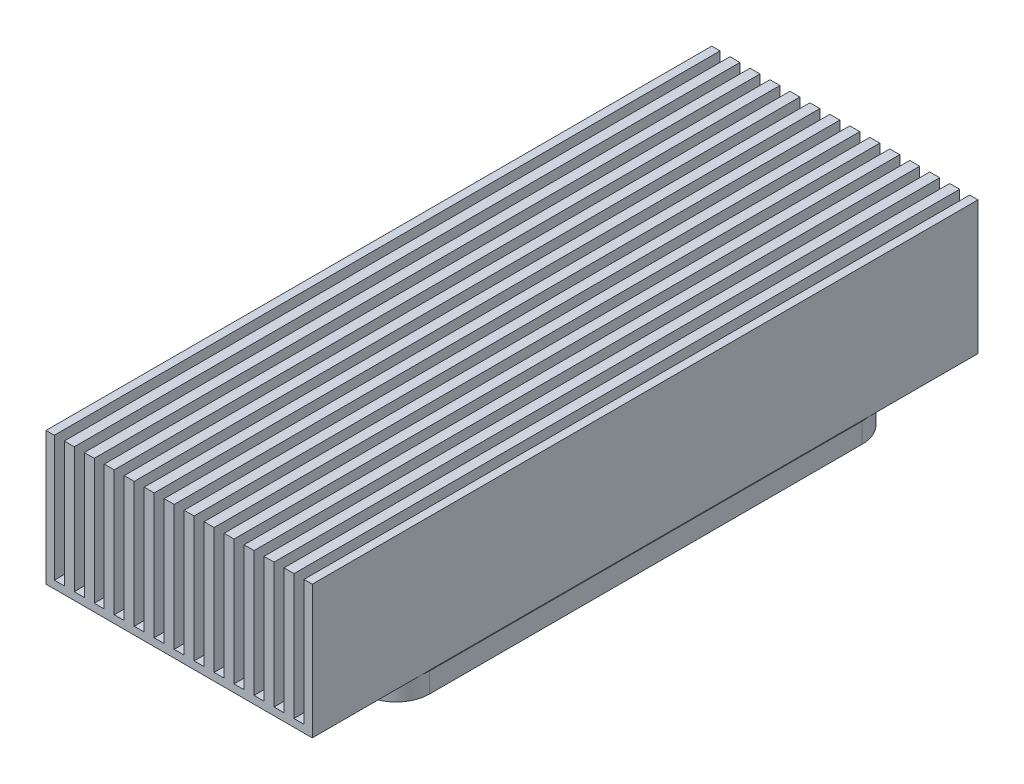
ISO-10303-21;
HEADER;
FILE_DESCRIPTION(('STEP AP214'),'2;1');
FILE_NAME('part.step','',(''),(''),'','','');
FILE_SCHEMA(('AUTOMOTIVE_DESIGN { 1 0 10303 214 1 1 1 1 }'));
ENDSEC;
DATA;
#1=APPLICATION_CONTEXT('core data for automotive mechanical design processes');
#2=APPLICATION_PROTOCOL_DEFINITION('international standard','automotive_design',2000,#1);
#3=PRODUCT_CONTEXT('',#1,'mechanical');
#4=PRODUCT('Part','Part','',(#3));
#5=PRODUCT_RELATED_PRODUCT_CATEGORY('part','',(#4));
#6=PRODUCT_DEFINITION_FORMATION('','',#4);
#7=PRODUCT_DEFINITION_CONTEXT('part definition',#1,'design');
#8=PRODUCT_DEFINITION('design','',#6,#7);
#9=PRODUCT_DEFINITION_SHAPE('','',#8);
#10=(LENGTH_UNIT() NAMED_UNIT(*) SI_UNIT(.MILLI.,.METRE.));
#11=(NAMED_UNIT(*) PLANE_ANGLE_UNIT() SI_UNIT($,.RADIAN.));
#12=(NAMED_UNIT(*) SI_UNIT($,.STERADIAN.) SOLID_ANGLE_UNIT());
#13=UNCERTAINTY_MEASURE_WITH_UNIT(LENGTH_MEASURE(1.E-05),#10,'distance_accuracy_value','');
#14=(GEOMETRIC_REPRESENTATION_CONTEXT(3) GLOBAL_UNCERTAINTY_ASSIGNED_CONTEXT((#13)) GLOBAL_UNIT_ASSIGNED_CONTEXT((#10,
#11,#12)) REPRESENTATION_CONTEXT('',''));
#15=CARTESIAN_POINT('',(0.,0.,0.));
#16=DIRECTION('',(0.,0.,1.));
#17=DIRECTION('',(1.,0.,0.));
#18=AXIS2_PLACEMENT_3D('',#15,#16,#17);
#19=CARTESIAN_POINT('',(-15.75,20.,50.));
#20=DIRECTION('',(-1.,0.,0.));
#21=DIRECTION('',(0.,-1.,0.));
#22=AXIS2_PLACEMENT_3D('',#19,#20,#21);
#23=PLANE('',#22);
#24=DIRECTION('',(0.,-1.,0.));
#25=VECTOR('',#24,1.);
#26=CARTESIAN_POINT('',(-15.75,17.,-17.8291561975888));
#27=LINE('',#26,#25);
#28=CARTESIAN_POINT('',(-15.7499999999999,1.14753958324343,-17.8291561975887));
#29=VERTEX_POINT('',#28);
#30=CARTESIAN_POINT('',(-15.75,17.,-17.8291561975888));
#31=VERTEX_POINT('',#30);
#32=EDGE_CURVE('E600',#29,#31,#27,.F.);
#33=ORIENTED_EDGE('',*,*,#32,.F.);
#34=DIRECTION('',(0.,0.,-1.));
#35=VECTOR('',#34,1.);
#36=CARTESIAN_POINT('',(-15.7499999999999,1.14753958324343,50.));
#37=LINE('',#36,#35);
#38=CARTESIAN_POINT('',(-15.7499999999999,1.14753958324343,-50.));
#39=VERTEX_POINT('',#38);
#40=EDGE_CURVE('E999',#29,#39,#37,.T.);
#41=ORIENTED_EDGE('',*,*,#40,.T.);
#42=DIRECTION('',(0.,1.,0.));
#43=VECTOR('',#42,1.);
#44=CARTESIAN_POINT('',(-15.75,20.,-50.));
#45=LINE('',#44,#43);
#46=CARTESIAN_POINT('',(-15.75,20.,-50.));
#47=VERTEX_POINT('',#46);
#48=EDGE_CURVE('E970',#39,#47,#45,.T.);
#49=ORIENTED_EDGE('',*,*,#48,.T.);
#50=DIRECTION('',(0.,0.,-1.));
#51=VECTOR('',#50,1.);
#52=CARTESIAN_POINT('',(-15.75,20.,50.));
#53=LINE('',#52,#51);
#54=CARTESIAN_POINT('',(-15.75,20.,50.));
#55=VERTEX_POINT('',#54);
#56=EDGE_CURVE('E996',#55,#47,#53,.T.);
#57=ORIENTED_EDGE('',*,*,#56,.F.);
#58=DIRECTION('',(0.,1.,0.));
#59=VECTOR('',#58,1.);
#60=CARTESIAN_POINT('',(-15.75,20.,50.));
#61=LINE('',#60,#59);
#62=CARTESIAN_POINT('',(-15.7499999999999,1.14753958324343,50.));
#63=VERTEX_POINT('',#62);
#64=EDGE_CURVE('E853',#63,#55,#61,.T.);
#65=ORIENTED_EDGE('',*,*,#64,.F.);
#66=CARTESIAN_POINT('',(-15.7499999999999,1.14753958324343,17.8291561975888));
#67=VERTEX_POINT('',#66);
#68=EDGE_CURVE('E1000',#63,#67,#37,.T.);
#69=ORIENTED_EDGE('',*,*,#68,.T.);
#70=DIRECTION('',(0.,-1.,0.));
#71=VECTOR('',#70,1.);
#72=CARTESIAN_POINT('',(-15.75,17.,17.8291561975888));
#73=LINE('',#72,#71);
#74=CARTESIAN_POINT('',(-15.75,17.,17.8291561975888));
#75=VERTEX_POINT('',#74);
#76=EDGE_CURVE('E640',#75,#67,#73,.T.);
#77=ORIENTED_EDGE('',*,*,#76,.F.);
#78=DIRECTION('',(0.,0.,-1.));
#79=VECTOR('',#78,1.);
#80=CARTESIAN_POINT('',(-15.75,17.,50.));
#81=LINE('',#80,#79);
#82=CARTESIAN_POINT('',(-15.75,17.,16.1708438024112));
#83=VERTEX_POINT('',#82);
#84=EDGE_CURVE('E647',#75,#83,#81,.T.);
#85=ORIENTED_EDGE('',*,*,#84,.T.);
#86=DIRECTION('',(0.,-1.,0.));
#87=VECTOR('',#86,1.);
#88=CARTESIAN_POINT('',(-15.75,17.,16.1708438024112));
#89=LINE('',#88,#87);
#90=CARTESIAN_POINT('',(-15.7499999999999,1.14753958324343,16.1708438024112));
#91=VERTEX_POINT('',#90);
#92=EDGE_CURVE('E644',#91,#83,#89,.F.);
#93=ORIENTED_EDGE('',*,*,#92,.F.);
#94=CARTESIAN_POINT('',(-15.7499999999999,1.14753958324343,-16.1708438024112));
#95=VERTEX_POINT('',#94);
#96=EDGE_CURVE('E1004',#91,#95,#37,.T.);
#97=ORIENTED_EDGE('',*,*,#96,.T.);
#98=DIRECTION('',(0.,-1.,0.));
#99=VECTOR('',#98,1.);
#100=CARTESIAN_POINT('',(-15.75,17.,-16.1708438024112));
#101=LINE('',#100,#99);
#102=CARTESIAN_POINT('',(-15.75,17.,-16.1708438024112));
#103=VERTEX_POINT('',#102);
#104=EDGE_CURVE('E598',#103,#95,#101,.T.);
#105=ORIENTED_EDGE('',*,*,#104,.F.);
#106=DIRECTION('',(0.,0.,-1.));
#107=VECTOR('',#106,1.);
#108=CARTESIAN_POINT('',(-15.75,17.,50.));
#109=LINE('',#108,#107);
#110=EDGE_CURVE('E584',#103,#31,#109,.T.);
#111=ORIENTED_EDGE('',*,*,#110,.T.);
#112=EDGE_LOOP('',(#33,#41,#49,#57,#65,#69,#77,#85,#93,#97,#105,#111));
#113=FACE_BOUND('',#112,.T.);
#114=ADVANCED_FACE('F33',(#113),#23,.F.);
#115=CARTESIAN_POINT('',(-17.2499999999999,1.14753958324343,50.));
#116=DIRECTION('',(1.,0.,0.));
#117=DIRECTION('',(0.,1.,0.));
#118=AXIS2_PLACEMENT_3D('',#115,#116,#117);
#119=PLANE('',#118);
#120=DIRECTION('',(0.,-1.,0.));
#121=VECTOR('',#120,1.);
#122=CARTESIAN_POINT('',(-17.2499999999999,17.,-15.5209800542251));
#123=LINE('',#122,#121);
#124=CARTESIAN_POINT('',(-17.2499999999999,1.14753958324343,-15.5209800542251));
#125=VERTEX_POINT('',#124);
#126=CARTESIAN_POINT('',(-17.2499999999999,17.,-15.5209800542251));
#127=VERTEX_POINT('',#126);
#128=EDGE_CURVE('E566',#125,#127,#123,.F.);
#129=ORIENTED_EDGE('',*,*,#128,.F.);
#130=DIRECTION('',(0.,0.,-1.));
#131=VECTOR('',#130,1.);
#132=CARTESIAN_POINT('',(-17.2499999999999,1.14753958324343,50.));
#133=LINE('',#132,#131);
#134=CARTESIAN_POINT('',(-17.2499999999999,1.14753958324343,15.5209800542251));
#135=VERTEX_POINT('',#134);
#136=EDGE_CURVE('E993',#135,#125,#133,.T.);
#137=ORIENTED_EDGE('',*,*,#136,.F.);
#138=DIRECTION('',(0.,-1.,0.));
#139=VECTOR('',#138,1.);
#140=CARTESIAN_POINT('',(-17.2499999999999,17.,15.5209800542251));
#141=LINE('',#140,#139);
#142=CARTESIAN_POINT('',(-17.2499999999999,17.,15.5209800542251));
#143=VERTEX_POINT('',#142);
#144=EDGE_CURVE('E633',#143,#135,#141,.T.);
#145=ORIENTED_EDGE('',*,*,#144,.F.);
#146=DIRECTION('',(0.,0.,1.));
#147=VECTOR('',#146,1.);
#148=CARTESIAN_POINT('',(-17.2499999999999,17.,50.));
#149=LINE('',#148,#147);
#150=CARTESIAN_POINT('',(-17.2499999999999,17.,18.4790199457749));
#151=VERTEX_POINT('',#150);
#152=EDGE_CURVE('E1161',#143,#151,#149,.T.);
#153=ORIENTED_EDGE('',*,*,#152,.T.);
#154=DIRECTION('',(0.,-1.,0.));
#155=VECTOR('',#154,1.);
#156=CARTESIAN_POINT('',(-17.2499999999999,17.,18.4790199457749));
#157=LINE('',#156,#155);
#158=CARTESIAN_POINT('',(-17.2499999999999,1.14753958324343,18.4790199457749));
#159=VERTEX_POINT('',#158);
#160=EDGE_CURVE('E638',#159,#151,#157,.F.);
#161=ORIENTED_EDGE('',*,*,#160,.F.);
#162=CARTESIAN_POINT('',(-17.2499999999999,1.14753958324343,50.));
#163=VERTEX_POINT('',#162);
#164=EDGE_CURVE('E989',#163,#159,#133,.T.);
#165=ORIENTED_EDGE('',*,*,#164,.F.);
#166=DIRECTION('',(0.,-1.,0.));
#167=VECTOR('',#166,1.);
#168=CARTESIAN_POINT('',(-17.2499999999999,1.14753958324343,50.));
#169=LINE('',#168,#167);
#170=CARTESIAN_POINT('',(-17.2499999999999,20.,50.));
#171=VERTEX_POINT('',#170);
#172=EDGE_CURVE('E857',#171,#163,#169,.T.);
#173=ORIENTED_EDGE('',*,*,#172,.F.);
#174=DIRECTION('',(0.,0.,-1.));
#175=VECTOR('',#174,1.);
#176=CARTESIAN_POINT('',(-17.2499999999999,20.,50.));
#177=LINE('',#176,#175);
#178=CARTESIAN_POINT('',(-17.2499999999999,20.,-50.));
#179=VERTEX_POINT('',#178);
#180=EDGE_CURVE('E992',#171,#179,#177,.T.);
#181=ORIENTED_EDGE('',*,*,#180,.T.);
#182=DIRECTION('',(0.,-1.,0.));
#183=VECTOR('',#182,1.);
#184=CARTESIAN_POINT('',(-17.2499999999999,1.14753958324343,-50.));
#185=LINE('',#184,#183);
#186=CARTESIAN_POINT('',(-17.2499999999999,1.14753958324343,-50.));
#187=VERTEX_POINT('',#186);
#188=EDGE_CURVE('E974',#179,#187,#185,.T.);
#189=ORIENTED_EDGE('',*,*,#188,.T.);
#190=CARTESIAN_POINT('',(-17.2499999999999,1.14753958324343,-18.4790199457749));
#191=VERTEX_POINT('',#190);
#192=EDGE_CURVE('E591',#191,#187,#133,.T.);
#193=ORIENTED_EDGE('',*,*,#192,.F.);
#194=DIRECTION('',(0.,-1.,0.));
#195=VECTOR('',#194,1.);
#196=CARTESIAN_POINT('',(-17.2499999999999,17.,-18.4790199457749));
#197=LINE('',#196,#195);
#198=CARTESIAN_POINT('',(-17.2499999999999,17.,-18.4790199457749));
#199=VERTEX_POINT('',#198);
#200=EDGE_CURVE('E577',#199,#191,#197,.T.);
#201=ORIENTED_EDGE('',*,*,#200,.F.);
#202=DIRECTION('',(0.,0.,1.));
#203=VECTOR('',#202,1.);
#204=CARTESIAN_POINT('',(-17.2499999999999,17.,50.));
#205=LINE('',#204,#203);
#206=EDGE_CURVE('E11',#199,#127,#205,.T.);
#207=ORIENTED_EDGE('',*,*,#206,.T.);
#208=EDGE_LOOP('',(#129,#137,#145,#153,#161,#165,#173,#181,#189,#193,#201,#207));
#209=FACE_BOUND('',#208,.T.);
#210=ADVANCED_FACE('F588',(#209),#119,.F.);
#211=CARTESIAN_POINT('',(17.25,20.,50.));
#212=DIRECTION('',(-1.,0.,0.));
#213=DIRECTION('',(0.,-1.,0.));
#214=AXIS2_PLACEMENT_3D('',#211,#212,#213);
#215=PLANE('',#214);
#216=DIRECTION('',(0.,-1.,0.));
#217=VECTOR('',#216,1.);
#218=CARTESIAN_POINT('',(17.25,17.,-18.4790199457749));
#219=LINE('',#218,#217);
#220=CARTESIAN_POINT('',(17.25,1.14753958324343,-18.4790199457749));
#221=VERTEX_POINT('',#220);
#222=CARTESIAN_POINT('',(17.25,17.,-18.4790199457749));
#223=VERTEX_POINT('',#222);
#224=EDGE_CURVE('E620',#221,#223,#219,.F.);
#225=ORIENTED_EDGE('',*,*,#224,.F.);
#226=DIRECTION('',(0.,0.,-1.));
#227=VECTOR('',#226,1.);
#228=CARTESIAN_POINT('',(17.25,1.14753958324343,50.));
#229=LINE('',#228,#227);
#230=CARTESIAN_POINT('',(17.25,1.14753958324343,-50.));
#231=VERTEX_POINT('',#230);
#232=EDGE_CURVE('E1135',#221,#231,#229,.T.);
#233=ORIENTED_EDGE('',*,*,#232,.T.);
#234=DIRECTION('',(0.,1.,0.));
#235=VECTOR('',#234,1.);
#236=CARTESIAN_POINT('',(17.25,20.,-50.));
#237=LINE('',#236,#235);
#238=CARTESIAN_POINT('',(17.25,20.,-50.));
#239=VERTEX_POINT('',#238);
#240=EDGE_CURVE('E880',#231,#239,#237,.T.);
#241=ORIENTED_EDGE('',*,*,#240,.T.);
#242=DIRECTION('',(0.,0.,-1.));
#243=VECTOR('',#242,1.);
#244=CARTESIAN_POINT('',(17.25,20.,50.));
#245=LINE('',#244,#243);
#246=CARTESIAN_POINT('',(17.25,20.,50.));
#247=VERTEX_POINT('',#246);
#248=EDGE_CURVE('E1132',#247,#239,#245,.T.);
#249=ORIENTED_EDGE('',*,*,#248,.F.);
#250=DIRECTION('',(0.,1.,0.));
#251=VECTOR('',#250,1.);
#252=CARTESIAN_POINT('',(17.25,20.,50.));
#253=LINE('',#252,#251);
#254=CARTESIAN_POINT('',(17.25,1.14753958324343,50.));
#255=VERTEX_POINT('',#254);
#256=EDGE_CURVE('E765',#255,#247,#253,.T.);
#257=ORIENTED_EDGE('',*,*,#256,.F.);
#258=CARTESIAN_POINT('',(17.25,1.14753958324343,18.4790199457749));
#259=VERTEX_POINT('',#258);
#260=EDGE_CURVE('E1136',#255,#259,#229,.T.);
#261=ORIENTED_EDGE('',*,*,#260,.T.);
#262=DIRECTION('',(0.,-1.,0.));
#263=VECTOR('',#262,1.);
#264=CARTESIAN_POINT('',(17.25,17.,18.4790199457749));
#265=LINE('',#264,#263);
#266=CARTESIAN_POINT('',(17.25,17.,18.4790199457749));
#267=VERTEX_POINT('',#266);
#268=EDGE_CURVE('E606',#267,#259,#265,.T.);
#269=ORIENTED_EDGE('',*,*,#268,.F.);
#270=DIRECTION('',(0.,0.,-1.));
#271=VECTOR('',#270,1.);
#272=CARTESIAN_POINT('',(17.25,17.,50.));
#273=LINE('',#272,#271);
#274=CARTESIAN_POINT('',(17.25,17.,15.5209800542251));
#275=VERTEX_POINT('',#274);
#276=EDGE_CURVE('E622',#267,#275,#273,.T.);
#277=ORIENTED_EDGE('',*,*,#276,.T.);
#278=DIRECTION('',(0.,-1.,0.));
#279=VECTOR('',#278,1.);
#280=CARTESIAN_POINT('',(17.25,17.,15.5209800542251));
#281=LINE('',#280,#279);
#282=CARTESIAN_POINT('',(17.25,1.14753958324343,15.5209800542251));
#283=VERTEX_POINT('',#282);
#284=EDGE_CURVE('E610',#283,#275,#281,.F.);
#285=ORIENTED_EDGE('',*,*,#284,.F.);
#286=CARTESIAN_POINT('',(17.25,1.14753958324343,-15.5209800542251));
#287=VERTEX_POINT('',#286);
#288=EDGE_CURVE('E1140',#283,#287,#229,.T.);
#289=ORIENTED_EDGE('',*,*,#288,.T.);
#290=DIRECTION('',(0.,-1.,0.));
#291=VECTOR('',#290,1.);
#292=CARTESIAN_POINT('',(17.25,17.,-15.5209800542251));
#293=LINE('',#292,#291);
#294=CARTESIAN_POINT('',(17.25,17.,-15.5209800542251));
#295=VERTEX_POINT('',#294);
#296=EDGE_CURVE('E616',#295,#287,#293,.T.);
#297=ORIENTED_EDGE('',*,*,#296,.F.);
#298=DIRECTION('',(0.,0.,-1.));
#299=VECTOR('',#298,1.);
#300=CARTESIAN_POINT('',(17.25,17.,50.));
#301=LINE('',#300,#299);
#302=EDGE_CURVE('E625',#295,#223,#301,.T.);
#303=ORIENTED_EDGE('',*,*,#302,.T.);
#304=EDGE_LOOP('',(#225,#233,#241,#249,#257,#261,#269,#277,#285,#289,#297,#303));
#305=FACE_BOUND('',#304,.T.);
#306=ADVANCED_FACE('F1214',(#305),#215,.F.);
#307=CARTESIAN_POINT('',(15.75,1.14753958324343,50.));
#308=DIRECTION('',(1.,0.,0.));
#309=DIRECTION('',(0.,1.,0.));
#310=AXIS2_PLACEMENT_3D('',#307,#308,#309);
#311=PLANE('',#310);
#312=DIRECTION('',(0.,-1.,0.));
#313=VECTOR('',#312,1.);
#314=CARTESIAN_POINT('',(15.75,17.,-16.1708438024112));
#315=LINE('',#314,#313);
#316=CARTESIAN_POINT('',(15.75,1.14753958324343,-16.1708438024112));
#317=VERTEX_POINT('',#316);
#318=CARTESIAN_POINT('',(15.75,17.,-16.1708438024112));
#319=VERTEX_POINT('',#318);
#320=EDGE_CURVE('E614',#317,#319,#315,.F.);
#321=ORIENTED_EDGE('',*,*,#320,.F.);
#322=DIRECTION('',(0.,0.,-1.));
#323=VECTOR('',#322,1.);
#324=CARTESIAN_POINT('',(15.75,1.14753958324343,50.));
#325=LINE('',#324,#323);
#326=CARTESIAN_POINT('',(15.75,1.14753958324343,16.1708438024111));
#327=VERTEX_POINT('',#326);
#328=EDGE_CURVE('E1129',#327,#317,#325,.T.);
#329=ORIENTED_EDGE('',*,*,#328,.F.);
#330=DIRECTION('',(0.,-1.,0.));
#331=VECTOR('',#330,1.);
#332=CARTESIAN_POINT('',(15.75,17.,16.1708438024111));
#333=LINE('',#332,#331);
#334=CARTESIAN_POINT('',(15.75,17.,16.1708438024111));
#335=VERTEX_POINT('',#334);
#336=EDGE_CURVE('E602',#335,#327,#333,.T.);
#337=ORIENTED_EDGE('',*,*,#336,.F.);
#338=DIRECTION('',(0.,0.,1.));
#339=VECTOR('',#338,1.);
#340=CARTESIAN_POINT('',(15.75,17.,50.));
#341=LINE('',#340,#339);
#342=CARTESIAN_POINT('',(15.75,17.,17.8291561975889));
#343=VERTEX_POINT('',#342);
#344=EDGE_CURVE('E1169',#335,#343,#341,.T.);
#345=ORIENTED_EDGE('',*,*,#344,.T.);
#346=DIRECTION('',(0.,-1.,0.));
#347=VECTOR('',#346,1.);
#348=CARTESIAN_POINT('',(15.75,17.,17.8291561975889));
#349=LINE('',#348,#347);
#350=CARTESIAN_POINT('',(15.75,1.14753958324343,17.8291561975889));
#351=VERTEX_POINT('',#350);
#352=EDGE_CURVE('E604',#351,#343,#349,.F.);
#353=ORIENTED_EDGE('',*,*,#352,.F.);
#354=CARTESIAN_POINT('',(15.75,1.14753958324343,50.));
#355=VERTEX_POINT('',#354);
#356=EDGE_CURVE('E1125',#355,#351,#325,.T.);
#357=ORIENTED_EDGE('',*,*,#356,.F.);
#358=DIRECTION('',(0.,-1.,0.));
#359=VECTOR('',#358,1.);
#360=CARTESIAN_POINT('',(15.75,1.14753958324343,50.));
#361=LINE('',#360,#359);
#362=CARTESIAN_POINT('',(15.75,20.,50.));
#363=VERTEX_POINT('',#362);
#364=EDGE_CURVE('E769',#363,#355,#361,.T.);
#365=ORIENTED_EDGE('',*,*,#364,.F.);
#366=DIRECTION('',(0.,0.,-1.));
#367=VECTOR('',#366,1.);
#368=CARTESIAN_POINT('',(15.75,20.,50.));
#369=LINE('',#368,#367);
#370=CARTESIAN_POINT('',(15.75,20.,-50.));
#371=VERTEX_POINT('',#370);
#372=EDGE_CURVE('E1128',#363,#371,#369,.T.);
#373=ORIENTED_EDGE('',*,*,#372,.T.);
#374=DIRECTION('',(0.,-1.,0.));
#375=VECTOR('',#374,1.);
#376=CARTESIAN_POINT('',(15.75,1.14753958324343,-50.));
#377=LINE('',#376,#375);
#378=CARTESIAN_POINT('',(15.75,1.14753958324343,-50.));
#379=VERTEX_POINT('',#378);
#380=EDGE_CURVE('E884',#371,#379,#377,.T.);
#381=ORIENTED_EDGE('',*,*,#380,.T.);
#382=CARTESIAN_POINT('',(15.75,1.14753958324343,-17.8291561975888));
#383=VERTEX_POINT('',#382);
#384=EDGE_CURVE('E1124',#383,#379,#325,.T.);
#385=ORIENTED_EDGE('',*,*,#384,.F.);
#386=DIRECTION('',(0.,-1.,0.));
#387=VECTOR('',#386,1.);
#388=CARTESIAN_POINT('',(15.75,17.,-17.8291561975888));
#389=LINE('',#388,#387);
#390=CARTESIAN_POINT('',(15.75,17.,-17.8291561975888));
#391=VERTEX_POINT('',#390);
#392=EDGE_CURVE('E612',#391,#383,#389,.T.);
#393=ORIENTED_EDGE('',*,*,#392,.F.);
#394=DIRECTION('',(0.,0.,1.));
#395=VECTOR('',#394,1.);
#396=CARTESIAN_POINT('',(15.75,17.,50.));
#397=LINE('',#396,#395);
#398=EDGE_CURVE('E41',#391,#319,#397,.T.);
#399=ORIENTED_EDGE('',*,*,#398,.T.);
#400=EDGE_LOOP('',(#321,#329,#337,#345,#353,#357,#365,#373,#381,#385,#393,#399));
#401=FACE_BOUND('',#400,.T.);
#402=ADVANCED_FACE('F1175',(#401),#311,.F.);
#403=CARTESIAN_POINT('',(15.1,-3.,32.5));
#404=DIRECTION('',(0.,1.,0.));
#405=DIRECTION('',(-1.,0.,0.));
#406=AXIS2_PLACEMENT_3D('',#403,#404,#405);
#407=PLANE('',#406);
#408=CARTESIAN_POINT('',(-17.,-3.,-17.));
#409=DIRECTION('',(0.,1.,0.));
#410=DIRECTION('',(-1.,0.,0.));
#411=AXIS2_PLACEMENT_3D('',#408,#409,#410);
#412=CIRCLE('',#411,1.5);
#413=CARTESIAN_POINT('',(-18.5,-3.,-17.));
#414=VERTEX_POINT('',#413);
#415=EDGE_CURVE('E1189',#414,#414,#412,.T.);
#416=ORIENTED_EDGE('',*,*,#415,.T.);
#417=EDGE_LOOP('',(#416));
#418=FACE_BOUND('',#417,.T.);
#419=CARTESIAN_POINT('',(17.,-3.,-17.));
#420=DIRECTION('',(0.,1.,0.));
#421=DIRECTION('',(-1.,0.,0.));
#422=AXIS2_PLACEMENT_3D('',#419,#420,#421);
#423=CIRCLE('',#422,1.5);
#424=CARTESIAN_POINT('',(15.5,-3.,-17.));
#425=VERTEX_POINT('',#424);
#426=EDGE_CURVE('E1187',#425,#425,#423,.T.);
#427=ORIENTED_EDGE('',*,*,#426,.T.);
#428=EDGE_LOOP('',(#427));
#429=FACE_BOUND('',#428,.T.);
#430=CARTESIAN_POINT('',(17.,-3.,17.));
#431=DIRECTION('',(0.,1.,0.));
#432=DIRECTION('',(-1.,0.,0.));
#433=AXIS2_PLACEMENT_3D('',#430,#431,#432);
#434=CIRCLE('',#433,1.50000000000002);
#435=CARTESIAN_POINT('',(15.5,-3.,17.));
#436=VERTEX_POINT('',#435);
#437=EDGE_CURVE('E594',#436,#436,#434,.T.);
#438=ORIENTED_EDGE('',*,*,#437,.T.);
#439=EDGE_LOOP('',(#438));
#440=FACE_BOUND('',#439,.T.);
#441=CARTESIAN_POINT('',(-17.,-3.,17.));
#442=DIRECTION('',(0.,1.,0.));
#443=DIRECTION('',(-1.,0.,0.));
#444=AXIS2_PLACEMENT_3D('',#441,#442,#443);
#445=CIRCLE('',#444,1.5);
#446=CARTESIAN_POINT('',(-18.5,-3.,17.));
#447=VERTEX_POINT('',#446);
#448=EDGE_CURVE('E629',#447,#447,#445,.T.);
#449=ORIENTED_EDGE('',*,*,#448,.T.);
#450=EDGE_LOOP('',(#449));
#451=FACE_BOUND('',#450,.T.);
#452=CARTESIAN_POINT('',(15.1,-3.,32.5));
#453=DIRECTION('',(0.,-1.,0.));
#454=DIRECTION('',(-1.,0.,0.));
#455=AXIS2_PLACEMENT_3D('',#452,#453,#454);
#456=CIRCLE('',#455,5.);
#457=CARTESIAN_POINT('',(20.1,-3.,32.5));
#458=VERTEX_POINT('',#457);
#459=CARTESIAN_POINT('',(15.1,-3.,37.5));
#460=VERTEX_POINT('',#459);
#461=EDGE_CURVE('E684',#458,#460,#456,.T.);
#462=ORIENTED_EDGE('',*,*,#461,.T.);
#463=DIRECTION('',(-1.,0.,0.));
#464=VECTOR('',#463,1.);
#465=CARTESIAN_POINT('',(-15.1,-3.,37.5));
#466=LINE('',#465,#464);
#467=CARTESIAN_POINT('',(-15.1,-3.,37.5));
#468=VERTEX_POINT('',#467);
#469=EDGE_CURVE('E687',#460,#468,#466,.T.);
#470=ORIENTED_EDGE('',*,*,#469,.T.);
#471=CARTESIAN_POINT('',(-15.1,-3.,32.5));
#472=DIRECTION('',(0.,-1.,0.));
#473=DIRECTION('',(1.,0.,0.));
#474=AXIS2_PLACEMENT_3D('',#471,#472,#473);
#475=CIRCLE('',#474,5.);
#476=CARTESIAN_POINT('',(-20.1,-3.,32.5));
#477=VERTEX_POINT('',#476);
#478=EDGE_CURVE('E690',#468,#477,#475,.T.);
#479=ORIENTED_EDGE('',*,*,#478,.T.);
#480=DIRECTION('',(0.,0.,-1.));
#481=VECTOR('',#480,1.);
#482=CARTESIAN_POINT('',(-20.1,-3.,-32.5));
#483=LINE('',#482,#481);
#484=CARTESIAN_POINT('',(-20.1,-3.,-32.5));
#485=VERTEX_POINT('',#484);
#486=EDGE_CURVE('E692',#477,#485,#483,.T.);
#487=ORIENTED_EDGE('',*,*,#486,.T.);
#488=CARTESIAN_POINT('',(-15.1,-3.,-32.5));
#489=DIRECTION('',(0.,-1.,0.));
#490=DIRECTION('',(1.,0.,0.));
#491=AXIS2_PLACEMENT_3D('',#488,#489,#490);
#492=CIRCLE('',#491,5.);
#493=CARTESIAN_POINT('',(-15.1,-3.,-37.5));
#494=VERTEX_POINT('',#493);
#495=EDGE_CURVE('E694',#485,#494,#492,.T.);
#496=ORIENTED_EDGE('',*,*,#495,.T.);
#497=DIRECTION('',(1.,0.,0.));
#498=VECTOR('',#497,1.);
#499=CARTESIAN_POINT('',(-15.1,-3.,-37.5));
#500=LINE('',#499,#498);
#501=CARTESIAN_POINT('',(15.1,-3.,-37.5));
#502=VERTEX_POINT('',#501);
#503=EDGE_CURVE('E696',#494,#502,#500,.T.);
#504=ORIENTED_EDGE('',*,*,#503,.T.);
#505=CARTESIAN_POINT('',(15.1,-3.,-32.5));
#506=DIRECTION('',(0.,-1.,0.));
#507=DIRECTION('',(-1.,0.,0.));
#508=AXIS2_PLACEMENT_3D('',#505,#506,#507);
#509=CIRCLE('',#508,5.);
#510=CARTESIAN_POINT('',(20.1,-3.,-32.5));
#511=VERTEX_POINT('',#510);
#512=EDGE_CURVE('E698',#502,#511,#509,.T.);
#513=ORIENTED_EDGE('',*,*,#512,.T.);
#514=DIRECTION('',(0.,0.,1.));
#515=VECTOR('',#514,1.);
#516=CARTESIAN_POINT('',(20.1,-3.,-32.5));
#517=LINE('',#516,#515);
#518=EDGE_CURVE('E700',#511,#458,#517,.T.);
#519=ORIENTED_EDGE('',*,*,#518,.T.);
#520=EDGE_LOOP('',(#462,#470,#479,#487,#496,#504,#513,#519));
#521=FACE_BOUND('',#520,.T.);
#522=DIRECTION('',(0.,0.,-1.));
#523=VECTOR('',#522,1.);
#524=CARTESIAN_POINT('',(-12.5,-3.,12.5));
#525=LINE('',#524,#523);
#526=CARTESIAN_POINT('',(-12.5,-3.,12.5));
#527=VERTEX_POINT('',#526);
#528=CARTESIAN_POINT('',(-12.5,-3.,-12.5));
#529=VERTEX_POINT('',#528);
#530=EDGE_CURVE('E650',#527,#529,#525,.T.);
#531=ORIENTED_EDGE('',*,*,#530,.F.);
#532=DIRECTION('',(-1.,0.,0.));
#533=VECTOR('',#532,1.);
#534=CARTESIAN_POINT('',(12.5,-3.,12.5));
#535=LINE('',#534,#533);
#536=CARTESIAN_POINT('',(12.5,-3.,12.5));
#537=VERTEX_POINT('',#536);
#538=EDGE_CURVE('E655',#537,#527,#535,.T.);
#539=ORIENTED_EDGE('',*,*,#538,.F.);
#540=DIRECTION('',(0.,0.,1.));
#541=VECTOR('',#540,1.);
#542=CARTESIAN_POINT('',(12.5,-3.,12.5));
#543=LINE('',#542,#541);
#544=CARTESIAN_POINT('',(12.5,-3.,-12.5));
#545=VERTEX_POINT('',#544);
#546=EDGE_CURVE('E667',#545,#537,#543,.T.);
#547=ORIENTED_EDGE('',*,*,#546,.F.);
#548=DIRECTION('',(1.,0.,0.));
#549=VECTOR('',#548,1.);
#550=CARTESIAN_POINT('',(12.5,-3.,-12.5));
#551=LINE('',#550,#549);
#552=EDGE_CURVE('E664',#529,#545,#551,.T.);
#553=ORIENTED_EDGE('',*,*,#552,.F.);
#554=EDGE_LOOP('',(#531,#539,#547,#553));
#555=FACE_BOUND('',#554,.T.);
#556=ADVANCED_FACE('F1202',(#418,#429,#440,#451,#521,#555),#407,.F.);
#557=CARTESIAN_POINT('',(-20.,0.,50.));
#558=DIRECTION('',(0.,1.,0.));
#559=DIRECTION('',(-1.,0.,0.));
#560=AXIS2_PLACEMENT_3D('',#557,#558,#559);
#561=PLANE('',#560);
#562=CARTESIAN_POINT('',(15.1,0.,-32.5));
#563=DIRECTION('',(0.,-1.,0.));
#564=DIRECTION('',(-1.,0.,0.));
#565=AXIS2_PLACEMENT_3D('',#562,#563,#564);
#566=CIRCLE('',#565,5.);
#567=CARTESIAN_POINT('',(15.1,0.,-37.5));
#568=VERTEX_POINT('',#567);
#569=CARTESIAN_POINT('',(20.,0.,-33.4949874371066));
#570=VERTEX_POINT('',#569);
#571=EDGE_CURVE('E723',#568,#570,#566,.T.);
#572=ORIENTED_EDGE('',*,*,#571,.F.);
#573=DIRECTION('',(1.,0.,0.));
#574=VECTOR('',#573,1.);
#575=CARTESIAN_POINT('',(-15.1,0.,-37.5));
#576=LINE('',#575,#574);
#577=CARTESIAN_POINT('',(-15.1,0.,-37.5));
#578=VERTEX_POINT('',#577);
#579=EDGE_CURVE('E718',#578,#568,#576,.T.);
#580=ORIENTED_EDGE('',*,*,#579,.F.);
#581=CARTESIAN_POINT('',(-15.1,0.,-32.5));
#582=DIRECTION('',(0.,-1.,0.));
#583=DIRECTION('',(1.,0.,0.));
#584=AXIS2_PLACEMENT_3D('',#581,#582,#583);
#585=CIRCLE('',#584,5.);
#586=CARTESIAN_POINT('',(-20.,0.,-33.4949874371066));
#587=VERTEX_POINT('',#586);
#588=EDGE_CURVE('E719',#587,#578,#585,.T.);
#589=ORIENTED_EDGE('',*,*,#588,.F.);
#590=DIRECTION('',(0.,0.,-1.));
#591=VECTOR('',#590,1.);
#592=CARTESIAN_POINT('',(-20.,0.,50.));
#593=LINE('',#592,#591);
#594=CARTESIAN_POINT('',(-20.,0.,-50.));
#595=VERTEX_POINT('',#594);
#596=EDGE_CURVE('E1153',#587,#595,#593,.T.);
#597=ORIENTED_EDGE('',*,*,#596,.T.);
#598=DIRECTION('',(1.,0.,0.));
#599=VECTOR('',#598,1.);
#600=CARTESIAN_POINT('',(-20.,0.,-50.));
#601=LINE('',#600,#599);
#602=CARTESIAN_POINT('',(20.,0.,-50.));
#603=VERTEX_POINT('',#602);
#604=EDGE_CURVE('E868',#595,#603,#601,.T.);
#605=ORIENTED_EDGE('',*,*,#604,.T.);
#606=DIRECTION('',(0.,0.,-1.));
#607=VECTOR('',#606,1.);
#608=CARTESIAN_POINT('',(20.,0.,50.));
#609=LINE('',#608,#607);
#610=EDGE_CURVE('E1149',#570,#603,#609,.T.);
#611=ORIENTED_EDGE('',*,*,#610,.F.);
#612=EDGE_LOOP('',(#572,#580,#589,#597,#605,#611));
#613=FACE_BOUND('',#612,.T.);
#614=ADVANCED_FACE('F1661',(#613),#561,.F.);
#615=CARTESIAN_POINT('',(15.1,0.,32.5));
#616=DIRECTION('',(0.,-1.,0.));
#617=DIRECTION('',(-1.,0.,0.));
#618=AXIS2_PLACEMENT_3D('',#615,#616,#617);
#619=CIRCLE('',#618,5.);
#620=CARTESIAN_POINT('',(20.,0.,33.4949874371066));
#621=VERTEX_POINT('',#620);
#622=CARTESIAN_POINT('',(15.1,0.,37.5));
#623=VERTEX_POINT('',#622);
#624=EDGE_CURVE('E706',#621,#623,#619,.T.);
#625=ORIENTED_EDGE('',*,*,#624,.F.);
#626=CARTESIAN_POINT('',(20.,0.,50.));
#627=VERTEX_POINT('',#626);
#628=EDGE_CURVE('E1150',#627,#621,#609,.T.);
#629=ORIENTED_EDGE('',*,*,#628,.F.);
#630=DIRECTION('',(1.,0.,0.));
#631=VECTOR('',#630,1.);
#632=CARTESIAN_POINT('',(-20.,0.,50.));
#633=LINE('',#632,#631);
#634=CARTESIAN_POINT('',(-20.,0.,50.));
#635=VERTEX_POINT('',#634);
#636=EDGE_CURVE('E754',#635,#627,#633,.T.);
#637=ORIENTED_EDGE('',*,*,#636,.F.);
#638=CARTESIAN_POINT('',(-20.,0.,33.4949874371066));
#639=VERTEX_POINT('',#638);
#640=EDGE_CURVE('E1155',#635,#639,#593,.T.);
#641=ORIENTED_EDGE('',*,*,#640,.T.);
#642=CARTESIAN_POINT('',(-15.1,0.,32.5));
#643=DIRECTION('',(0.,-1.,0.));
#644=DIRECTION('',(1.,0.,0.));
#645=AXIS2_PLACEMENT_3D('',#642,#643,#644);
#646=CIRCLE('',#645,5.);
#647=CARTESIAN_POINT('',(-15.1,0.,37.5));
#648=VERTEX_POINT('',#647);
#649=EDGE_CURVE('E710',#648,#639,#646,.T.);
#650=ORIENTED_EDGE('',*,*,#649,.F.);
#651=DIRECTION('',(-1.,0.,0.));
#652=VECTOR('',#651,1.);
#653=CARTESIAN_POINT('',(-15.1,0.,37.5));
#654=LINE('',#653,#652);
#655=EDGE_CURVE('E705',#623,#648,#654,.T.);
#656=ORIENTED_EDGE('',*,*,#655,.F.);
#657=EDGE_LOOP('',(#625,#629,#637,#641,#650,#656));
#658=FACE_BOUND('',#657,.T.);
#659=ADVANCED_FACE('F1514',(#658),#561,.F.);
#660=CARTESIAN_POINT('',(-20.,20.,50.));
#661=DIRECTION('',(1.,0.,0.));
#662=DIRECTION('',(0.,1.,0.));
#663=AXIS2_PLACEMENT_3D('',#660,#661,#662);
#664=PLANE('',#663);
#665=DIRECTION('',(0.,-1.,0.));
#666=VECTOR('',#665,1.);
#667=CARTESIAN_POINT('',(-20.,20.,-50.));
#668=LINE('',#667,#666);
#669=CARTESIAN_POINT('',(-20.,20.,-50.));
#670=VERTEX_POINT('',#669);
#671=EDGE_CURVE('E750',#670,#595,#668,.T.);
#672=ORIENTED_EDGE('',*,*,#671,.T.);
#673=ORIENTED_EDGE('',*,*,#596,.F.);
#674=EDGE_CURVE('E1158',#639,#587,#593,.T.);
#675=ORIENTED_EDGE('',*,*,#674,.F.);
#676=ORIENTED_EDGE('',*,*,#640,.F.);
#677=DIRECTION('',(0.,-1.,0.));
#678=VECTOR('',#677,1.);
#679=CARTESIAN_POINT('',(-20.,20.,50.));
#680=LINE('',#679,#678);
#681=CARTESIAN_POINT('',(-20.,20.,50.));
#682=VERTEX_POINT('',#681);
#683=EDGE_CURVE('E751',#682,#635,#680,.T.);
#684=ORIENTED_EDGE('',*,*,#683,.F.);
#685=DIRECTION('',(0.,0.,-1.));
#686=VECTOR('',#685,1.);
#687=CARTESIAN_POINT('',(-20.,20.,50.));
#688=LINE('',#687,#686);
#689=EDGE_CURVE('E865',#682,#670,#688,.T.);
#690=ORIENTED_EDGE('',*,*,#689,.T.);
#691=EDGE_LOOP('',(#672,#673,#675,#676,#684,#690));
#692=FACE_BOUND('',#691,.T.);
#693=ADVANCED_FACE('F35',(#692),#664,.F.);
#694=CARTESIAN_POINT('',(20.,20.,50.));
#695=DIRECTION('',(-1.,0.,0.));
#696=DIRECTION('',(0.,-1.,0.));
#697=AXIS2_PLACEMENT_3D('',#694,#695,#696);
#698=PLANE('',#697);
#699=DIRECTION('',(0.,1.,0.));
#700=VECTOR('',#699,1.);
#701=CARTESIAN_POINT('',(20.,20.,-50.));
#702=LINE('',#701,#700);
#703=CARTESIAN_POINT('',(20.,20.,-50.));
#704=VERTEX_POINT('',#703);
#705=EDGE_CURVE('E871',#603,#704,#702,.T.);
#706=ORIENTED_EDGE('',*,*,#705,.T.);
#707=DIRECTION('',(0.,0.,-1.));
#708=VECTOR('',#707,1.);
#709=CARTESIAN_POINT('',(20.,20.,50.));
#710=LINE('',#709,#708);
#711=CARTESIAN_POINT('',(20.,20.,50.));
#712=VERTEX_POINT('',#711);
#713=EDGE_CURVE('E1146',#712,#704,#710,.T.);
#714=ORIENTED_EDGE('',*,*,#713,.F.);
#715=DIRECTION('',(0.,1.,0.));
#716=VECTOR('',#715,1.);
#717=CARTESIAN_POINT('',(20.,20.,50.));
#718=LINE('',#717,#716);
#719=EDGE_CURVE('E757',#627,#712,#718,.T.);
#720=ORIENTED_EDGE('',*,*,#719,.F.);
#721=ORIENTED_EDGE('',*,*,#628,.T.);
#722=EDGE_CURVE('E1154',#621,#570,#609,.T.);
#723=ORIENTED_EDGE('',*,*,#722,.T.);
#724=ORIENTED_EDGE('',*,*,#610,.T.);
#725=EDGE_LOOP('',(#706,#714,#720,#721,#723,#724));
#726=FACE_BOUND('',#725,.T.);
#727=ADVANCED_FACE('F1260',(#726),#698,.F.);
#728=CARTESIAN_POINT('',(18.7499999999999,20.,50.));
#729=DIRECTION('',(0.,-1.,0.));
#730=DIRECTION('',(0.,0.,-1.));
#731=AXIS2_PLACEMENT_3D('',#728,#729,#730);
#732=PLANE('',#731);
#733=DIRECTION('',(-1.,0.,0.));
#734=VECTOR('',#733,1.);
#735=CARTESIAN_POINT('',(18.7499999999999,20.,-50.));
#736=LINE('',#735,#734);
#737=CARTESIAN_POINT('',(18.7499999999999,20.,-50.));
#738=VERTEX_POINT('',#737);
#739=EDGE_CURVE('E873',#704,#738,#736,.T.);
#740=ORIENTED_EDGE('',*,*,#739,.T.);
#741=DIRECTION('',(0.,0.,-1.));
#742=VECTOR('',#741,1.);
#743=CARTESIAN_POINT('',(18.7499999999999,20.,50.));
#744=LINE('',#743,#742);
#745=CARTESIAN_POINT('',(18.7499999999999,20.,50.));
#746=VERTEX_POINT('',#745);
#747=EDGE_CURVE('E1143',#746,#738,#744,.T.);
#748=ORIENTED_EDGE('',*,*,#747,.F.);
#749=DIRECTION('',(-1.,0.,0.));
#750=VECTOR('',#749,1.);
#751=CARTESIAN_POINT('',(18.7499999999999,20.,50.));
#752=LINE('',#751,#750);
#753=EDGE_CURVE('E759',#712,#746,#752,.T.);
#754=ORIENTED_EDGE('',*,*,#753,.F.);
#755=ORIENTED_EDGE('',*,*,#713,.T.);
#756=EDGE_LOOP('',(#740,#748,#754,#755));
#757=FACE_BOUND('',#756,.T.);
#758=ADVANCED_FACE('F1256',(#757),#732,.F.);
#759=CARTESIAN_POINT('',(18.75,1.14753958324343,50.));
#760=DIRECTION('',(1.,0.,0.));
#761=DIRECTION('',(0.,1.,0.));
#762=AXIS2_PLACEMENT_3D('',#759,#760,#761);
#763=PLANE('',#762);
#764=DIRECTION('',(0.,-1.,0.));
#765=VECTOR('',#764,1.);
#766=CARTESIAN_POINT('',(18.75,1.14753958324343,-50.));
#767=LINE('',#766,#765);
#768=CARTESIAN_POINT('',(18.75,1.14753958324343,-50.));
#769=VERTEX_POINT('',#768);
#770=EDGE_CURVE('E875',#738,#769,#767,.T.);
#771=ORIENTED_EDGE('',*,*,#770,.T.);
#772=DIRECTION('',(0.,0.,-1.));
#773=VECTOR('',#772,1.);
#774=CARTESIAN_POINT('',(18.75,1.14753958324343,50.));
#775=LINE('',#774,#773);
#776=CARTESIAN_POINT('',(18.75,1.14753958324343,50.));
#777=VERTEX_POINT('',#776);
#778=EDGE_CURVE('E1139',#777,#769,#775,.T.);
#779=ORIENTED_EDGE('',*,*,#778,.F.);
#780=DIRECTION('',(0.,-1.,0.));
#781=VECTOR('',#780,1.);
#782=CARTESIAN_POINT('',(18.75,1.14753958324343,50.));
#783=LINE('',#782,#781);
#784=EDGE_CURVE('E761',#746,#777,#783,.T.);
#785=ORIENTED_EDGE('',*,*,#784,.F.);
#786=ORIENTED_EDGE('',*,*,#747,.T.);
#787=EDGE_LOOP('',(#771,#779,#785,#786));
#788=FACE_BOUND('',#787,.T.);
#789=ADVANCED_FACE('F1251',(#788),#763,.F.);
#790=CARTESIAN_POINT('',(17.25,1.14753958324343,50.));
#791=DIRECTION('',(0.,-1.,0.));
#792=DIRECTION('',(0.,0.,-1.));
#793=AXIS2_PLACEMENT_3D('',#790,#791,#792);
#794=PLANE('',#793);
#795=CARTESIAN_POINT('',(17.,1.14753958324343,-17.));
#796=DIRECTION('',(0.,-1.,0.));
#797=DIRECTION('',(0.,0.,-1.));
#798=AXIS2_PLACEMENT_3D('',#795,#796,#797);
#799=CIRCLE('',#798,1.5);
#800=EDGE_CURVE('E618',#287,#221,#799,.F.);
#801=ORIENTED_EDGE('',*,*,#800,.F.);
#802=ORIENTED_EDGE('',*,*,#288,.F.);
#803=CARTESIAN_POINT('',(17.,1.14753958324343,17.));
#804=DIRECTION('',(0.,-1.,0.));
#805=DIRECTION('',(0.,0.,-1.));
#806=AXIS2_PLACEMENT_3D('',#803,#804,#805);
#807=CIRCLE('',#806,1.50000000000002);
#808=EDGE_CURVE('E608',#259,#283,#807,.F.);
#809=ORIENTED_EDGE('',*,*,#808,.F.);
#810=ORIENTED_EDGE('',*,*,#260,.F.);
#811=DIRECTION('',(-1.,0.,0.));
#812=VECTOR('',#811,1.);
#813=CARTESIAN_POINT('',(17.25,1.14753958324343,50.));
#814=LINE('',#813,#812);
#815=EDGE_CURVE('E763',#777,#255,#814,.T.);
#816=ORIENTED_EDGE('',*,*,#815,.F.);
#817=ORIENTED_EDGE('',*,*,#778,.T.);
#818=DIRECTION('',(-1.,0.,0.));
#819=VECTOR('',#818,1.);
#820=CARTESIAN_POINT('',(17.25,1.14753958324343,-50.));
#821=LINE('',#820,#819);
#822=EDGE_CURVE('E877',#769,#231,#821,.T.);
#823=ORIENTED_EDGE('',*,*,#822,.T.);
#824=ORIENTED_EDGE('',*,*,#232,.F.);
#825=EDGE_LOOP('',(#801,#802,#809,#810,#816,#817,#823,#824));
#826=FACE_BOUND('',#825,.T.);
#827=ADVANCED_FACE('F1244',(#826),#794,.F.);
#828=CARTESIAN_POINT('',(15.75,20.,50.));
#829=DIRECTION('',(0.,-1.,0.));
#830=DIRECTION('',(0.,0.,-1.));
#831=AXIS2_PLACEMENT_3D('',#828,#829,#830);
#832=PLANE('',#831);
#833=DIRECTION('',(-1.,0.,0.));
#834=VECTOR('',#833,1.);
#835=CARTESIAN_POINT('',(15.75,20.,-50.));
#836=LINE('',#835,#834);
#837=EDGE_CURVE('E882',#239,#371,#836,.T.);
#838=ORIENTED_EDGE('',*,*,#837,.T.);
#839=ORIENTED_EDGE('',*,*,#372,.F.);
#840=DIRECTION('',(-1.,0.,0.));
#841=VECTOR('',#840,1.);
#842=CARTESIAN_POINT('',(15.75,20.,50.));
#843=LINE('',#842,#841);
#844=EDGE_CURVE('E767',#247,#363,#843,.T.);
#845=ORIENTED_EDGE('',*,*,#844,.F.);
#846=ORIENTED_EDGE('',*,*,#248,.T.);
#847=EDGE_LOOP('',(#838,#839,#845,#846));
#848=FACE_BOUND('',#847,.T.);
#849=ADVANCED_FACE('F1231',(#848),#832,.F.);
#850=CARTESIAN_POINT('',(14.25,1.14753958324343,50.));
#851=DIRECTION('',(0.,-1.,0.));
#852=DIRECTION('',(0.,0.,-1.));
#853=AXIS2_PLACEMENT_3D('',#850,#851,#852);
#854=PLANE('',#853);
#855=CARTESIAN_POINT('',(17.,1.14753958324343,-17.));
#856=DIRECTION('',(0.,-1.,0.));
#857=DIRECTION('',(0.,0.,-1.));
#858=AXIS2_PLACEMENT_3D('',#855,#856,#857);
#859=CIRCLE('',#858,1.5);
#860=EDGE_CURVE('E1167',#383,#317,#859,.F.);
#861=ORIENTED_EDGE('',*,*,#860,.F.);
#862=ORIENTED_EDGE('',*,*,#384,.T.);
#863=DIRECTION('',(-1.,0.,0.));
#864=VECTOR('',#863,1.);
#865=CARTESIAN_POINT('',(14.25,1.14753958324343,-50.));
#866=LINE('',#865,#864);
#867=CARTESIAN_POINT('',(14.25,1.14753958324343,-50.));
#868=VERTEX_POINT('',#867);
#869=EDGE_CURVE('E887',#379,#868,#866,.T.);
#870=ORIENTED_EDGE('',*,*,#869,.T.);
#871=DIRECTION('',(0.,0.,-1.));
#872=VECTOR('',#871,1.);
#873=CARTESIAN_POINT('',(14.25,1.14753958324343,50.));
#874=LINE('',#873,#872);
#875=CARTESIAN_POINT('',(14.25,1.14753958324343,50.));
#876=VERTEX_POINT('',#875);
#877=EDGE_CURVE('E1121',#876,#868,#874,.T.);
#878=ORIENTED_EDGE('',*,*,#877,.F.);
#879=DIRECTION('',(-1.,0.,0.));
#880=VECTOR('',#879,1.);
#881=CARTESIAN_POINT('',(14.25,1.14753958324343,50.));
#882=LINE('',#881,#880);
#883=EDGE_CURVE('E771',#355,#876,#882,.T.);
#884=ORIENTED_EDGE('',*,*,#883,.F.);
#885=ORIENTED_EDGE('',*,*,#356,.T.);
#886=CARTESIAN_POINT('',(17.,1.14753958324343,17.));
#887=DIRECTION('',(0.,-1.,0.));
#888=DIRECTION('',(0.,0.,-1.));
#889=AXIS2_PLACEMENT_3D('',#886,#887,#888);
#890=CIRCLE('',#889,1.50000000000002);
#891=EDGE_CURVE('E1165',#327,#351,#890,.F.);
#892=ORIENTED_EDGE('',*,*,#891,.F.);
#893=ORIENTED_EDGE('',*,*,#328,.T.);
#894=EDGE_LOOP('',(#861,#862,#870,#878,#884,#885,#892,#893));
#895=FACE_BOUND('',#894,.T.);
#896=ADVANCED_FACE('F1219',(#895),#854,.F.);
#897=CARTESIAN_POINT('',(14.25,20.,50.));
#898=DIRECTION('',(-1.,0.,0.));
#899=DIRECTION('',(0.,-1.,0.));
#900=AXIS2_PLACEMENT_3D('',#897,#898,#899);
#901=PLANE('',#900);
#902=DIRECTION('',(0.,1.,0.));
#903=VECTOR('',#902,1.);
#904=CARTESIAN_POINT('',(14.25,20.,-50.));
#905=LINE('',#904,#903);
#906=CARTESIAN_POINT('',(14.25,20.,-50.));
#907=VERTEX_POINT('',#906);
#908=EDGE_CURVE('E889',#868,#907,#905,.T.);
#909=ORIENTED_EDGE('',*,*,#908,.T.);
#910=DIRECTION('',(0.,0.,-1.));
#911=VECTOR('',#910,1.);
#912=CARTESIAN_POINT('',(14.25,20.,50.));
#913=LINE('',#912,#911);
#914=CARTESIAN_POINT('',(14.25,20.,50.));
#915=VERTEX_POINT('',#914);
#916=EDGE_CURVE('E1118',#915,#907,#913,.T.);
#917=ORIENTED_EDGE('',*,*,#916,.F.);
#918=DIRECTION('',(0.,1.,0.));
#919=VECTOR('',#918,1.);
#920=CARTESIAN_POINT('',(14.25,20.,50.));
#921=LINE('',#920,#919);
#922=EDGE_CURVE('E773',#876,#915,#921,.T.);
#923=ORIENTED_EDGE('',*,*,#922,.F.);
#924=ORIENTED_EDGE('',*,*,#877,.T.);
#925=EDGE_LOOP('',(#909,#917,#923,#924));
#926=FACE_BOUND('',#925,.T.);
#927=ADVANCED_FACE('F1495',(#926),#901,.F.);
#928=CARTESIAN_POINT('',(12.75,20.,50.));
#929=DIRECTION('',(0.,-1.,0.));
#930=DIRECTION('',(0.,0.,-1.));
#931=AXIS2_PLACEMENT_3D('',#928,#929,#930);
#932=PLANE('',#931);
#933=DIRECTION('',(-1.,0.,0.));
#934=VECTOR('',#933,1.);
#935=CARTESIAN_POINT('',(12.75,20.,-50.));
#936=LINE('',#935,#934);
#937=CARTESIAN_POINT('',(12.75,20.,-50.));
#938=VERTEX_POINT('',#937);
#939=EDGE_CURVE('E891',#907,#938,#936,.T.);
#940=ORIENTED_EDGE('',*,*,#939,.T.);
#941=DIRECTION('',(0.,0.,-1.));
#942=VECTOR('',#941,1.);
#943=CARTESIAN_POINT('',(12.75,20.,50.));
#944=LINE('',#943,#942);
#945=CARTESIAN_POINT('',(12.75,20.,50.));
#946=VERTEX_POINT('',#945);
#947=EDGE_CURVE('E1115',#946,#938,#944,.T.);
#948=ORIENTED_EDGE('',*,*,#947,.F.);
#949=DIRECTION('',(-1.,0.,0.));
#950=VECTOR('',#949,1.);
#951=CARTESIAN_POINT('',(12.75,20.,50.));
#952=LINE('',#951,#950);
#953=EDGE_CURVE('E775',#915,#946,#952,.T.);
#954=ORIENTED_EDGE('',*,*,#953,.F.);
#955=ORIENTED_EDGE('',*,*,#916,.T.);
#956=EDGE_LOOP('',(#940,#948,#954,#955));
#957=FACE_BOUND('',#956,.T.);
#958=ADVANCED_FACE('F1491',(#957),#932,.F.);
#959=CARTESIAN_POINT('',(12.75,1.14753958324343,50.));
#960=DIRECTION('',(1.,0.,0.));
#961=DIRECTION('',(0.,1.,0.));
#962=AXIS2_PLACEMENT_3D('',#959,#960,#961);
#963=PLANE('',#962);
#964=DIRECTION('',(0.,-1.,0.));
#965=VECTOR('',#964,1.);
#966=CARTESIAN_POINT('',(12.75,1.14753958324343,-50.));
#967=LINE('',#966,#965);
#968=CARTESIAN_POINT('',(12.75,1.14753958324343,-50.));
#969=VERTEX_POINT('',#968);
#970=EDGE_CURVE('E893',#938,#969,#967,.T.);
#971=ORIENTED_EDGE('',*,*,#970,.T.);
#972=DIRECTION('',(0.,0.,-1.));
#973=VECTOR('',#972,1.);
#974=CARTESIAN_POINT('',(12.75,1.14753958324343,50.));
#975=LINE('',#974,#973);
#976=CARTESIAN_POINT('',(12.75,1.14753958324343,50.));
#977=VERTEX_POINT('',#976);
#978=EDGE_CURVE('E1112',#977,#969,#975,.T.);
#979=ORIENTED_EDGE('',*,*,#978,.F.);
#980=DIRECTION('',(0.,-1.,0.));
#981=VECTOR('',#980,1.);
#982=CARTESIAN_POINT('',(12.75,1.14753958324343,50.));
#983=LINE('',#982,#981);
#984=EDGE_CURVE('E777',#946,#977,#983,.T.);
#985=ORIENTED_EDGE('',*,*,#984,.F.);
#986=ORIENTED_EDGE('',*,*,#947,.T.);
#987=EDGE_LOOP('',(#971,#979,#985,#986));
#988=FACE_BOUND('',#987,.T.);
#989=ADVANCED_FACE('F1486',(#988),#963,.F.);
#990=CARTESIAN_POINT('',(11.25,1.14753958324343,50.));
#991=DIRECTION('',(0.,-1.,0.));
#992=DIRECTION('',(0.,0.,-1.));
#993=AXIS2_PLACEMENT_3D('',#990,#991,#992);
#994=PLANE('',#993);
#995=DIRECTION('',(-1.,0.,0.));
#996=VECTOR('',#995,1.);
#997=CARTESIAN_POINT('',(11.25,1.14753958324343,-50.));
#998=LINE('',#997,#996);
#999=CARTESIAN_POINT('',(11.25,1.14753958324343,-50.));
#1000=VERTEX_POINT('',#999);
#1001=EDGE_CURVE('E895',#969,#1000,#998,.T.);
#1002=ORIENTED_EDGE('',*,*,#1001,.T.);
#1003=DIRECTION('',(0.,0.,-1.));
#1004=VECTOR('',#1003,1.);
#1005=CARTESIAN_POINT('',(11.25,1.14753958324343,50.));
#1006=LINE('',#1005,#1004);
#1007=CARTESIAN_POINT('',(11.25,1.14753958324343,50.));
#1008=VERTEX_POINT('',#1007);
#1009=EDGE_CURVE('E1109',#1008,#1000,#1006,.T.);
#1010=ORIENTED_EDGE('',*,*,#1009,.F.);
#1011=DIRECTION('',(-1.,0.,0.));
#1012=VECTOR('',#1011,1.);
#1013=CARTESIAN_POINT('',(11.25,1.14753958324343,50.));
#1014=LINE('',#1013,#1012);
#1015=EDGE_CURVE('E779',#977,#1008,#1014,.T.);
#1016=ORIENTED_EDGE('',*,*,#1015,.F.);
#1017=ORIENTED_EDGE('',*,*,#978,.T.);
#1018=EDGE_LOOP('',(#1002,#1010,#1016,#1017));
#1019=FACE_BOUND('',#1018,.T.);
#1020=ADVANCED_FACE('F1481',(#1019),#994,.F.);
#1021=CARTESIAN_POINT('',(11.25,20.,50.));
#1022=DIRECTION('',(-1.,0.,0.));
#1023=DIRECTION('',(0.,-1.,0.));
#1024=AXIS2_PLACEMENT_3D('',#1021,#1022,#1023);
#1025=PLANE('',#1024);
#1026=DIRECTION('',(0.,1.,0.));
#1027=VECTOR('',#1026,1.);
#1028=CARTESIAN_POINT('',(11.25,20.,-50.));
#1029=LINE('',#1028,#1027);
#1030=CARTESIAN_POINT('',(11.25,20.,-50.));
#1031=VERTEX_POINT('',#1030);
#1032=EDGE_CURVE('E897',#1000,#1031,#1029,.T.);
#1033=ORIENTED_EDGE('',*,*,#1032,.T.);
#1034=DIRECTION('',(0.,0.,-1.));
#1035=VECTOR('',#1034,1.);
#1036=CARTESIAN_POINT('',(11.25,20.,50.));
#1037=LINE('',#1036,#1035);
#1038=CARTESIAN_POINT('',(11.25,20.,50.));
#1039=VERTEX_POINT('',#1038);
#1040=EDGE_CURVE('E1106',#1039,#1031,#1037,.T.);
#1041=ORIENTED_EDGE('',*,*,#1040,.F.);
#1042=DIRECTION('',(0.,1.,0.));
#1043=VECTOR('',#1042,1.);
#1044=CARTESIAN_POINT('',(11.25,20.,50.));
#1045=LINE('',#1044,#1043);
#1046=EDGE_CURVE('E781',#1008,#1039,#1045,.T.);
#1047=ORIENTED_EDGE('',*,*,#1046,.F.);
#1048=ORIENTED_EDGE('',*,*,#1009,.T.);
#1049=EDGE_LOOP('',(#1033,#1041,#1047,#1048));
#1050=FACE_BOUND('',#1049,.T.);
#1051=ADVANCED_FACE('F1477',(#1050),#1025,.F.);
#1052=CARTESIAN_POINT('',(9.75,20.,50.));
#1053=DIRECTION('',(0.,-1.,0.));
#1054=DIRECTION('',(0.,0.,-1.));
#1055=AXIS2_PLACEMENT_3D('',#1052,#1053,#1054);
#1056=PLANE('',#1055);
#1057=DIRECTION('',(-1.,0.,0.));
#1058=VECTOR('',#1057,1.);
#1059=CARTESIAN_POINT('',(9.75,20.,-50.));
#1060=LINE('',#1059,#1058);
#1061=CARTESIAN_POINT('',(9.75,20.,-50.));
#1062=VERTEX_POINT('',#1061);
#1063=EDGE_CURVE('E899',#1031,#1062,#1060,.T.);
#1064=ORIENTED_EDGE('',*,*,#1063,.T.);
#1065=DIRECTION('',(0.,0.,-1.));
#1066=VECTOR('',#1065,1.);
#1067=CARTESIAN_POINT('',(9.75,20.,50.));
#1068=LINE('',#1067,#1066);
#1069=CARTESIAN_POINT('',(9.75,20.,50.));
#1070=VERTEX_POINT('',#1069);
#1071=EDGE_CURVE('E1103',#1070,#1062,#1068,.T.);
#1072=ORIENTED_EDGE('',*,*,#1071,.F.);
#1073=DIRECTION('',(-1.,0.,0.));
#1074=VECTOR('',#1073,1.);
#1075=CARTESIAN_POINT('',(9.75,20.,50.));
#1076=LINE('',#1075,#1074);
#1077=EDGE_CURVE('E783',#1039,#1070,#1076,.T.);
#1078=ORIENTED_EDGE('',*,*,#1077,.F.);
#1079=ORIENTED_EDGE('',*,*,#1040,.T.);
#1080=EDGE_LOOP('',(#1064,#1072,#1078,#1079));
#1081=FACE_BOUND('',#1080,.T.);
#1082=ADVANCED_FACE('F1472',(#1081),#1056,.F.);
#1083=CARTESIAN_POINT('',(9.75000000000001,1.14753958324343,50.));
#1084=DIRECTION('',(1.,0.,0.));
#1085=DIRECTION('',(0.,1.,0.));
#1086=AXIS2_PLACEMENT_3D('',#1083,#1084,#1085);
#1087=PLANE('',#1086);
#1088=DIRECTION('',(0.,-1.,0.));
#1089=VECTOR('',#1088,1.);
#1090=CARTESIAN_POINT('',(9.75000000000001,1.14753958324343,-50.));
#1091=LINE('',#1090,#1089);
#1092=CARTESIAN_POINT('',(9.75000000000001,1.14753958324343,-50.));
#1093=VERTEX_POINT('',#1092);
#1094=EDGE_CURVE('E901',#1062,#1093,#1091,.T.);
#1095=ORIENTED_EDGE('',*,*,#1094,.T.);
#1096=DIRECTION('',(0.,0.,-1.));
#1097=VECTOR('',#1096,1.);
#1098=CARTESIAN_POINT('',(9.75000000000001,1.14753958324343,50.));
#1099=LINE('',#1098,#1097);
#1100=CARTESIAN_POINT('',(9.75000000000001,1.14753958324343,50.));
#1101=VERTEX_POINT('',#1100);
#1102=EDGE_CURVE('E1100',#1101,#1093,#1099,.T.);
#1103=ORIENTED_EDGE('',*,*,#1102,.F.);
#1104=DIRECTION('',(0.,-1.,0.));
#1105=VECTOR('',#1104,1.);
#1106=CARTESIAN_POINT('',(9.75000000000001,1.14753958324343,50.));
#1107=LINE('',#1106,#1105);
#1108=EDGE_CURVE('E785',#1070,#1101,#1107,.T.);
#1109=ORIENTED_EDGE('',*,*,#1108,.F.);
#1110=ORIENTED_EDGE('',*,*,#1071,.T.);
#1111=EDGE_LOOP('',(#1095,#1103,#1109,#1110));
#1112=FACE_BOUND('',#1111,.T.);
#1113=ADVANCED_FACE('F1466',(#1112),#1087,.F.);
#1114=CARTESIAN_POINT('',(8.25000000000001,1.14753958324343,50.));
#1115=DIRECTION('',(0.,-1.,0.));
#1116=DIRECTION('',(0.,0.,-1.));
#1117=AXIS2_PLACEMENT_3D('',#1114,#1115,#1116);
#1118=PLANE('',#1117);
#1119=DIRECTION('',(-1.,0.,0.));
#1120=VECTOR('',#1119,1.);
#1121=CARTESIAN_POINT('',(8.25000000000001,1.14753958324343,-50.));
#1122=LINE('',#1121,#1120);
#1123=CARTESIAN_POINT('',(8.25000000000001,1.14753958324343,-50.));
#1124=VERTEX_POINT('',#1123);
#1125=EDGE_CURVE('E903',#1093,#1124,#1122,.T.);
#1126=ORIENTED_EDGE('',*,*,#1125,.T.);
#1127=DIRECTION('',(0.,0.,-1.));
#1128=VECTOR('',#1127,1.);
#1129=CARTESIAN_POINT('',(8.25000000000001,1.14753958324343,50.));
#1130=LINE('',#1129,#1128);
#1131=CARTESIAN_POINT('',(8.25000000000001,1.14753958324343,50.));
#1132=VERTEX_POINT('',#1131);
#1133=EDGE_CURVE('E1097',#1132,#1124,#1130,.T.);
#1134=ORIENTED_EDGE('',*,*,#1133,.F.);
#1135=DIRECTION('',(-1.,0.,0.));
#1136=VECTOR('',#1135,1.);
#1137=CARTESIAN_POINT('',(8.25000000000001,1.14753958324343,50.));
#1138=LINE('',#1137,#1136);
#1139=EDGE_CURVE('E787',#1101,#1132,#1138,.T.);
#1140=ORIENTED_EDGE('',*,*,#1139,.F.);
#1141=ORIENTED_EDGE('',*,*,#1102,.T.);
#1142=EDGE_LOOP('',(#1126,#1134,#1140,#1141));
#1143=FACE_BOUND('',#1142,.T.);
#1144=ADVANCED_FACE('F1462',(#1143),#1118,.F.);
#1145=CARTESIAN_POINT('',(8.25,20.,50.));
#1146=DIRECTION('',(-1.,0.,0.));
#1147=DIRECTION('',(0.,-1.,0.));
#1148=AXIS2_PLACEMENT_3D('',#1145,#1146,#1147);
#1149=PLANE('',#1148);
#1150=DIRECTION('',(0.,1.,0.));
#1151=VECTOR('',#1150,1.);
#1152=CARTESIAN_POINT('',(8.25,20.,-50.));
#1153=LINE('',#1152,#1151);
#1154=CARTESIAN_POINT('',(8.25,20.,-50.));
#1155=VERTEX_POINT('',#1154);
#1156=EDGE_CURVE('E905',#1124,#1155,#1153,.T.);
#1157=ORIENTED_EDGE('',*,*,#1156,.T.);
#1158=DIRECTION('',(0.,0.,-1.));
#1159=VECTOR('',#1158,1.);
#1160=CARTESIAN_POINT('',(8.25,20.,50.));
#1161=LINE('',#1160,#1159);
#1162=CARTESIAN_POINT('',(8.25,20.,50.));
#1163=VERTEX_POINT('',#1162);
#1164=EDGE_CURVE('E1094',#1163,#1155,#1161,.T.);
#1165=ORIENTED_EDGE('',*,*,#1164,.F.);
#1166=DIRECTION('',(0.,1.,0.));
#1167=VECTOR('',#1166,1.);
#1168=CARTESIAN_POINT('',(8.25,20.,50.));
#1169=LINE('',#1168,#1167);
#1170=EDGE_CURVE('E789',#1132,#1163,#1169,.T.);
#1171=ORIENTED_EDGE('',*,*,#1170,.F.);
#1172=ORIENTED_EDGE('',*,*,#1133,.T.);
#1173=EDGE_LOOP('',(#1157,#1165,#1171,#1172));
#1174=FACE_BOUND('',#1173,.T.);
#1175=ADVANCED_FACE('F1457',(#1174),#1149,.F.);
#1176=CARTESIAN_POINT('',(6.75000000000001,20.,50.));
#1177=DIRECTION('',(0.,-1.,0.));
#1178=DIRECTION('',(0.,0.,-1.));
#1179=AXIS2_PLACEMENT_3D('',#1176,#1177,#1178);
#1180=PLANE('',#1179);
#1181=DIRECTION('',(-1.,0.,0.));
#1182=VECTOR('',#1181,1.);
#1183=CARTESIAN_POINT('',(6.75000000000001,20.,-50.));
#1184=LINE('',#1183,#1182);
#1185=CARTESIAN_POINT('',(6.75000000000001,20.,-50.));
#1186=VERTEX_POINT('',#1185);
#1187=EDGE_CURVE('E907',#1155,#1186,#1184,.T.);
#1188=ORIENTED_EDGE('',*,*,#1187,.T.);
#1189=DIRECTION('',(0.,0.,-1.));
#1190=VECTOR('',#1189,1.);
#1191=CARTESIAN_POINT('',(6.75000000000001,20.,50.));
#1192=LINE('',#1191,#1190);
#1193=CARTESIAN_POINT('',(6.75000000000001,20.,50.));
#1194=VERTEX_POINT('',#1193);
#1195=EDGE_CURVE('E1091',#1194,#1186,#1192,.T.);
#1196=ORIENTED_EDGE('',*,*,#1195,.F.);
#1197=DIRECTION('',(-1.,0.,0.));
#1198=VECTOR('',#1197,1.);
#1199=CARTESIAN_POINT('',(6.75000000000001,20.,50.));
#1200=LINE('',#1199,#1198);
#1201=EDGE_CURVE('E791',#1163,#1194,#1200,.T.);
#1202=ORIENTED_EDGE('',*,*,#1201,.F.);
#1203=ORIENTED_EDGE('',*,*,#1164,.T.);
#1204=EDGE_LOOP('',(#1188,#1196,#1202,#1203));
#1205=FACE_BOUND('',#1204,.T.);
#1206=ADVANCED_FACE('F1451',(#1205),#1180,.F.);
#1207=CARTESIAN_POINT('',(6.75000000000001,1.14753958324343,50.));
#1208=DIRECTION('',(1.,0.,0.));
#1209=DIRECTION('',(0.,1.,0.));
#1210=AXIS2_PLACEMENT_3D('',#1207,#1208,#1209);
#1211=PLANE('',#1210);
#1212=DIRECTION('',(0.,-1.,0.));
#1213=VECTOR('',#1212,1.);
#1214=CARTESIAN_POINT('',(6.75000000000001,1.14753958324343,-50.));
#1215=LINE('',#1214,#1213);
#1216=CARTESIAN_POINT('',(6.75000000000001,1.14753958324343,-50.));
#1217=VERTEX_POINT('',#1216);
#1218=EDGE_CURVE('E909',#1186,#1217,#1215,.T.);
#1219=ORIENTED_EDGE('',*,*,#1218,.T.);
#1220=DIRECTION('',(0.,0.,-1.));
#1221=VECTOR('',#1220,1.);
#1222=CARTESIAN_POINT('',(6.75000000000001,1.14753958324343,50.));
#1223=LINE('',#1222,#1221);
#1224=CARTESIAN_POINT('',(6.75000000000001,1.14753958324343,50.));
#1225=VERTEX_POINT('',#1224);
#1226=EDGE_CURVE('E1088',#1225,#1217,#1223,.T.);
#1227=ORIENTED_EDGE('',*,*,#1226,.F.);
#1228=DIRECTION('',(0.,-1.,0.));
#1229=VECTOR('',#1228,1.);
#1230=CARTESIAN_POINT('',(6.75000000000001,1.14753958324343,50.));
#1231=LINE('',#1230,#1229);
#1232=EDGE_CURVE('E793',#1194,#1225,#1231,.T.);
#1233=ORIENTED_EDGE('',*,*,#1232,.F.);
#1234=ORIENTED_EDGE('',*,*,#1195,.T.);
#1235=EDGE_LOOP('',(#1219,#1227,#1233,#1234));
#1236=FACE_BOUND('',#1235,.T.);
#1237=ADVANCED_FACE('F1447',(#1236),#1211,.F.);
#1238=CARTESIAN_POINT('',(5.25000000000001,1.14753958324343,50.));
#1239=DIRECTION('',(0.,-1.,0.));
#1240=DIRECTION('',(0.,0.,-1.));
#1241=AXIS2_PLACEMENT_3D('',#1238,#1239,#1240);
#1242=PLANE('',#1241);
#1243=DIRECTION('',(-1.,0.,0.));
#1244=VECTOR('',#1243,1.);
#1245=CARTESIAN_POINT('',(5.25000000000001,1.14753958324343,-50.));
#1246=LINE('',#1245,#1244);
#1247=CARTESIAN_POINT('',(5.25000000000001,1.14753958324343,-50.));
#1248=VERTEX_POINT('',#1247);
#1249=EDGE_CURVE('E911',#1217,#1248,#1246,.T.);
#1250=ORIENTED_EDGE('',*,*,#1249,.T.);
#1251=DIRECTION('',(0.,0.,-1.));
#1252=VECTOR('',#1251,1.);
#1253=CARTESIAN_POINT('',(5.25000000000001,1.14753958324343,50.));
#1254=LINE('',#1253,#1252);
#1255=CARTESIAN_POINT('',(5.25000000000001,1.14753958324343,50.));
#1256=VERTEX_POINT('',#1255);
#1257=EDGE_CURVE('E1085',#1256,#1248,#1254,.T.);
#1258=ORIENTED_EDGE('',*,*,#1257,.F.);
#1259=DIRECTION('',(-1.,0.,0.));
#1260=VECTOR('',#1259,1.);
#1261=CARTESIAN_POINT('',(5.25000000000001,1.14753958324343,50.));
#1262=LINE('',#1261,#1260);
#1263=EDGE_CURVE('E795',#1225,#1256,#1262,.T.);
#1264=ORIENTED_EDGE('',*,*,#1263,.F.);
#1265=ORIENTED_EDGE('',*,*,#1226,.T.);
#1266=EDGE_LOOP('',(#1250,#1258,#1264,#1265));
#1267=FACE_BOUND('',#1266,.T.);
#1268=ADVANCED_FACE('F1442',(#1267),#1242,.F.);
#1269=CARTESIAN_POINT('',(5.25000000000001,20.,50.));
#1270=DIRECTION('',(-1.,0.,0.));
#1271=DIRECTION('',(0.,-1.,0.));
#1272=AXIS2_PLACEMENT_3D('',#1269,#1270,#1271);
#1273=PLANE('',#1272);
#1274=DIRECTION('',(0.,1.,0.));
#1275=VECTOR('',#1274,1.);
#1276=CARTESIAN_POINT('',(5.25000000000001,20.,-50.));
#1277=LINE('',#1276,#1275);
#1278=CARTESIAN_POINT('',(5.25000000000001,20.,-50.));
#1279=VERTEX_POINT('',#1278);
#1280=EDGE_CURVE('E913',#1248,#1279,#1277,.T.);
#1281=ORIENTED_EDGE('',*,*,#1280,.T.);
#1282=DIRECTION('',(0.,0.,-1.));
#1283=VECTOR('',#1282,1.);
#1284=CARTESIAN_POINT('',(5.25000000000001,20.,50.));
#1285=LINE('',#1284,#1283);
#1286=CARTESIAN_POINT('',(5.25000000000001,20.,50.));
#1287=VERTEX_POINT('',#1286);
#1288=EDGE_CURVE('E1082',#1287,#1279,#1285,.T.);
#1289=ORIENTED_EDGE('',*,*,#1288,.F.);
#1290=DIRECTION('',(0.,1.,0.));
#1291=VECTOR('',#1290,1.);
#1292=CARTESIAN_POINT('',(5.25000000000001,20.,50.));
#1293=LINE('',#1292,#1291);
#1294=EDGE_CURVE('E797',#1256,#1287,#1293,.T.);
#1295=ORIENTED_EDGE('',*,*,#1294,.F.);
#1296=ORIENTED_EDGE('',*,*,#1257,.T.);
#1297=EDGE_LOOP('',(#1281,#1289,#1295,#1296));
#1298=FACE_BOUND('',#1297,.T.);
#1299=ADVANCED_FACE('F1436',(#1298),#1273,.F.);
#1300=CARTESIAN_POINT('',(3.75000000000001,20.,50.));
#1301=DIRECTION('',(0.,-1.,0.));
#1302=DIRECTION('',(0.,0.,-1.));
#1303=AXIS2_PLACEMENT_3D('',#1300,#1301,#1302);
#1304=PLANE('',#1303);
#1305=DIRECTION('',(-1.,0.,0.));
#1306=VECTOR('',#1305,1.);
#1307=CARTESIAN_POINT('',(3.75000000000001,20.,-50.));
#1308=LINE('',#1307,#1306);
#1309=CARTESIAN_POINT('',(3.75000000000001,20.,-50.));
#1310=VERTEX_POINT('',#1309);
#1311=EDGE_CURVE('E915',#1279,#1310,#1308,.T.);
#1312=ORIENTED_EDGE('',*,*,#1311,.T.);
#1313=DIRECTION('',(0.,0.,-1.));
#1314=VECTOR('',#1313,1.);
#1315=CARTESIAN_POINT('',(3.75000000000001,20.,50.));
#1316=LINE('',#1315,#1314);
#1317=CARTESIAN_POINT('',(3.75000000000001,20.,50.));
#1318=VERTEX_POINT('',#1317);
#1319=EDGE_CURVE('E1079',#1318,#1310,#1316,.T.);
#1320=ORIENTED_EDGE('',*,*,#1319,.F.);
#1321=DIRECTION('',(-1.,0.,0.));
#1322=VECTOR('',#1321,1.);
#1323=CARTESIAN_POINT('',(3.75000000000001,20.,50.));
#1324=LINE('',#1323,#1322);
#1325=EDGE_CURVE('E799',#1287,#1318,#1324,.T.);
#1326=ORIENTED_EDGE('',*,*,#1325,.F.);
#1327=ORIENTED_EDGE('',*,*,#1288,.T.);
#1328=EDGE_LOOP('',(#1312,#1320,#1326,#1327));
#1329=FACE_BOUND('',#1328,.T.);
#1330=ADVANCED_FACE('F1432',(#1329),#1304,.F.);
#1331=CARTESIAN_POINT('',(3.75000000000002,1.14753958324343,50.));
#1332=DIRECTION('',(1.,0.,0.));
#1333=DIRECTION('',(0.,1.,0.));
#1334=AXIS2_PLACEMENT_3D('',#1331,#1332,#1333);
#1335=PLANE('',#1334);
#1336=DIRECTION('',(0.,-1.,0.));
#1337=VECTOR('',#1336,1.);
#1338=CARTESIAN_POINT('',(3.75000000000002,1.14753958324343,-50.));
#1339=LINE('',#1338,#1337);
#1340=CARTESIAN_POINT('',(3.75000000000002,1.14753958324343,-50.));
#1341=VERTEX_POINT('',#1340);
#1342=EDGE_CURVE('E917',#1310,#1341,#1339,.T.);
#1343=ORIENTED_EDGE('',*,*,#1342,.T.);
#1344=DIRECTION('',(0.,0.,-1.));
#1345=VECTOR('',#1344,1.);
#1346=CARTESIAN_POINT('',(3.75000000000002,1.14753958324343,50.));
#1347=LINE('',#1346,#1345);
#1348=CARTESIAN_POINT('',(3.75000000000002,1.14753958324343,50.));
#1349=VERTEX_POINT('',#1348);
#1350=EDGE_CURVE('E1076',#1349,#1341,#1347,.T.);
#1351=ORIENTED_EDGE('',*,*,#1350,.F.);
#1352=DIRECTION('',(0.,-1.,0.));
#1353=VECTOR('',#1352,1.);
#1354=CARTESIAN_POINT('',(3.75000000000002,1.14753958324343,50.));
#1355=LINE('',#1354,#1353);
#1356=EDGE_CURVE('E801',#1318,#1349,#1355,.T.);
#1357=ORIENTED_EDGE('',*,*,#1356,.F.);
#1358=ORIENTED_EDGE('',*,*,#1319,.T.);
#1359=EDGE_LOOP('',(#1343,#1351,#1357,#1358));
#1360=FACE_BOUND('',#1359,.T.);
#1361=ADVANCED_FACE('F1427',(#1360),#1335,.F.);
#1362=CARTESIAN_POINT('',(2.25000000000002,1.14753958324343,50.));
#1363=DIRECTION('',(0.,-1.,0.));
#1364=DIRECTION('',(0.,0.,-1.));
#1365=AXIS2_PLACEMENT_3D('',#1362,#1363,#1364);
#1366=PLANE('',#1365);
#1367=DIRECTION('',(-1.,0.,0.));
#1368=VECTOR('',#1367,1.);
#1369=CARTESIAN_POINT('',(2.25000000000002,1.14753958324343,-50.));
#1370=LINE('',#1369,#1368);
#1371=CARTESIAN_POINT('',(2.25000000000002,1.14753958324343,-50.));
#1372=VERTEX_POINT('',#1371);
#1373=EDGE_CURVE('E919',#1341,#1372,#1370,.T.);
#1374=ORIENTED_EDGE('',*,*,#1373,.T.);
#1375=DIRECTION('',(0.,0.,-1.));
#1376=VECTOR('',#1375,1.);
#1377=CARTESIAN_POINT('',(2.25000000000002,1.14753958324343,50.));
#1378=LINE('',#1377,#1376);
#1379=CARTESIAN_POINT('',(2.25000000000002,1.14753958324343,50.));
#1380=VERTEX_POINT('',#1379);
#1381=EDGE_CURVE('E1073',#1380,#1372,#1378,.T.);
#1382=ORIENTED_EDGE('',*,*,#1381,.F.);
#1383=DIRECTION('',(-1.,0.,0.));
#1384=VECTOR('',#1383,1.);
#1385=CARTESIAN_POINT('',(2.25000000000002,1.14753958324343,50.));
#1386=LINE('',#1385,#1384);
#1387=EDGE_CURVE('E803',#1349,#1380,#1386,.T.);
#1388=ORIENTED_EDGE('',*,*,#1387,.F.);
#1389=ORIENTED_EDGE('',*,*,#1350,.T.);
#1390=EDGE_LOOP('',(#1374,#1382,#1388,#1389));
#1391=FACE_BOUND('',#1390,.T.);
#1392=ADVANCED_FACE('F1421',(#1391),#1366,.F.);
#1393=CARTESIAN_POINT('',(2.25000000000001,20.,50.));
#1394=DIRECTION('',(-1.,0.,0.));
#1395=DIRECTION('',(0.,-1.,0.));
#1396=AXIS2_PLACEMENT_3D('',#1393,#1394,#1395);
#1397=PLANE('',#1396);
#1398=DIRECTION('',(0.,1.,0.));
#1399=VECTOR('',#1398,1.);
#1400=CARTESIAN_POINT('',(2.25000000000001,20.,-50.));
#1401=LINE('',#1400,#1399);
#1402=CARTESIAN_POINT('',(2.25000000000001,20.,-50.));
#1403=VERTEX_POINT('',#1402);
#1404=EDGE_CURVE('E921',#1372,#1403,#1401,.T.);
#1405=ORIENTED_EDGE('',*,*,#1404,.T.);
#1406=DIRECTION('',(0.,0.,-1.));
#1407=VECTOR('',#1406,1.);
#1408=CARTESIAN_POINT('',(2.25000000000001,20.,50.));
#1409=LINE('',#1408,#1407);
#1410=CARTESIAN_POINT('',(2.25000000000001,20.,50.));
#1411=VERTEX_POINT('',#1410);
#1412=EDGE_CURVE('E1070',#1411,#1403,#1409,.T.);
#1413=ORIENTED_EDGE('',*,*,#1412,.F.);
#1414=DIRECTION('',(0.,1.,0.));
#1415=VECTOR('',#1414,1.);
#1416=CARTESIAN_POINT('',(2.25000000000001,20.,50.));
#1417=LINE('',#1416,#1415);
#1418=EDGE_CURVE('E805',#1380,#1411,#1417,.T.);
#1419=ORIENTED_EDGE('',*,*,#1418,.F.);
#1420=ORIENTED_EDGE('',*,*,#1381,.T.);
#1421=EDGE_LOOP('',(#1405,#1413,#1419,#1420));
#1422=FACE_BOUND('',#1421,.T.);
#1423=ADVANCED_FACE('F1417',(#1422),#1397,.F.);
#1424=CARTESIAN_POINT('',(0.750000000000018,20.,50.));
#1425=DIRECTION('',(0.,-1.,0.));
#1426=DIRECTION('',(0.,0.,-1.));
#1427=AXIS2_PLACEMENT_3D('',#1424,#1425,#1426);
#1428=PLANE('',#1427);
#1429=DIRECTION('',(-1.,0.,0.));
#1430=VECTOR('',#1429,1.);
#1431=CARTESIAN_POINT('',(0.750000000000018,20.,-50.));
#1432=LINE('',#1431,#1430);
#1433=CARTESIAN_POINT('',(0.750000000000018,20.,-50.));
#1434=VERTEX_POINT('',#1433);
#1435=EDGE_CURVE('E923',#1403,#1434,#1432,.T.);
#1436=ORIENTED_EDGE('',*,*,#1435,.T.);
#1437=DIRECTION('',(0.,0.,-1.));
#1438=VECTOR('',#1437,1.);
#1439=CARTESIAN_POINT('',(0.750000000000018,20.,50.));
#1440=LINE('',#1439,#1438);
#1441=CARTESIAN_POINT('',(0.750000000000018,20.,50.));
#1442=VERTEX_POINT('',#1441);
#1443=EDGE_CURVE('E1067',#1442,#1434,#1440,.T.);
#1444=ORIENTED_EDGE('',*,*,#1443,.F.);
#1445=DIRECTION('',(-1.,0.,0.));
#1446=VECTOR('',#1445,1.);
#1447=CARTESIAN_POINT('',(0.750000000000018,20.,50.));
#1448=LINE('',#1447,#1446);
#1449=EDGE_CURVE('E807',#1411,#1442,#1448,.T.);
#1450=ORIENTED_EDGE('',*,*,#1449,.F.);
#1451=ORIENTED_EDGE('',*,*,#1412,.T.);
#1452=EDGE_LOOP('',(#1436,#1444,#1450,#1451));
#1453=FACE_BOUND('',#1452,.T.);
#1454=ADVANCED_FACE('F1412',(#1453),#1428,.F.);
#1455=CARTESIAN_POINT('',(0.750000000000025,1.14753958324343,50.));
#1456=DIRECTION('',(1.,0.,0.));
#1457=DIRECTION('',(0.,1.,0.));
#1458=AXIS2_PLACEMENT_3D('',#1455,#1456,#1457);
#1459=PLANE('',#1458);
#1460=DIRECTION('',(0.,-1.,0.));
#1461=VECTOR('',#1460,1.);
#1462=CARTESIAN_POINT('',(0.750000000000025,1.14753958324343,-50.));
#1463=LINE('',#1462,#1461);
#1464=CARTESIAN_POINT('',(0.750000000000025,1.14753958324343,-50.));
#1465=VERTEX_POINT('',#1464);
#1466=EDGE_CURVE('E925',#1434,#1465,#1463,.T.);
#1467=ORIENTED_EDGE('',*,*,#1466,.T.);
#1468=DIRECTION('',(0.,0.,-1.));
#1469=VECTOR('',#1468,1.);
#1470=CARTESIAN_POINT('',(0.750000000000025,1.14753958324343,50.));
#1471=LINE('',#1470,#1469);
#1472=CARTESIAN_POINT('',(0.750000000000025,1.14753958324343,50.));
#1473=VERTEX_POINT('',#1472);
#1474=EDGE_CURVE('E1064',#1473,#1465,#1471,.T.);
#1475=ORIENTED_EDGE('',*,*,#1474,.F.);
#1476=DIRECTION('',(0.,-1.,0.));
#1477=VECTOR('',#1476,1.);
#1478=CARTESIAN_POINT('',(0.750000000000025,1.14753958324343,50.));
#1479=LINE('',#1478,#1477);
#1480=EDGE_CURVE('E809',#1442,#1473,#1479,.T.);
#1481=ORIENTED_EDGE('',*,*,#1480,.F.);
#1482=ORIENTED_EDGE('',*,*,#1443,.T.);
#1483=EDGE_LOOP('',(#1467,#1475,#1481,#1482));
#1484=FACE_BOUND('',#1483,.T.);
#1485=ADVANCED_FACE('F1406',(#1484),#1459,.F.);
#1486=CARTESIAN_POINT('',(-0.749999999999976,1.14753958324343,50.));
#1487=DIRECTION('',(0.,-1.,0.));
#1488=DIRECTION('',(0.,0.,-1.));
#1489=AXIS2_PLACEMENT_3D('',#1486,#1487,#1488);
#1490=PLANE('',#1489);
#1491=DIRECTION('',(-1.,0.,0.));
#1492=VECTOR('',#1491,1.);
#1493=CARTESIAN_POINT('',(-0.749999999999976,1.14753958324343,-50.));
#1494=LINE('',#1493,#1492);
#1495=CARTESIAN_POINT('',(-0.749999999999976,1.14753958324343,-50.));
#1496=VERTEX_POINT('',#1495);
#1497=EDGE_CURVE('E927',#1465,#1496,#1494,.T.);
#1498=ORIENTED_EDGE('',*,*,#1497,.T.);
#1499=DIRECTION('',(0.,0.,-1.));
#1500=VECTOR('',#1499,1.);
#1501=CARTESIAN_POINT('',(-0.749999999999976,1.14753958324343,50.));
#1502=LINE('',#1501,#1500);
#1503=CARTESIAN_POINT('',(-0.749999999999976,1.14753958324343,50.));
#1504=VERTEX_POINT('',#1503);
#1505=EDGE_CURVE('E1061',#1504,#1496,#1502,.T.);
#1506=ORIENTED_EDGE('',*,*,#1505,.F.);
#1507=DIRECTION('',(-1.,0.,0.));
#1508=VECTOR('',#1507,1.);
#1509=CARTESIAN_POINT('',(-0.749999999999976,1.14753958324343,50.));
#1510=LINE('',#1509,#1508);
#1511=EDGE_CURVE('E811',#1473,#1504,#1510,.T.);
#1512=ORIENTED_EDGE('',*,*,#1511,.F.);
#1513=ORIENTED_EDGE('',*,*,#1474,.T.);
#1514=EDGE_LOOP('',(#1498,#1506,#1512,#1513));
#1515=FACE_BOUND('',#1514,.T.);
#1516=ADVANCED_FACE('F1402',(#1515),#1490,.F.);
#1517=CARTESIAN_POINT('',(-0.74999999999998,20.,50.));
#1518=DIRECTION('',(-1.,0.,0.));
#1519=DIRECTION('',(0.,-1.,0.));
#1520=AXIS2_PLACEMENT_3D('',#1517,#1518,#1519);
#1521=PLANE('',#1520);
#1522=DIRECTION('',(0.,1.,0.));
#1523=VECTOR('',#1522,1.);
#1524=CARTESIAN_POINT('',(-0.74999999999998,20.,-50.));
#1525=LINE('',#1524,#1523);
#1526=CARTESIAN_POINT('',(-0.74999999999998,20.,-50.));
#1527=VERTEX_POINT('',#1526);
#1528=EDGE_CURVE('E929',#1496,#1527,#1525,.T.);
#1529=ORIENTED_EDGE('',*,*,#1528,.T.);
#1530=DIRECTION('',(0.,0.,-1.));
#1531=VECTOR('',#1530,1.);
#1532=CARTESIAN_POINT('',(-0.74999999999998,20.,50.));
#1533=LINE('',#1532,#1531);
#1534=CARTESIAN_POINT('',(-0.74999999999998,20.,50.));
#1535=VERTEX_POINT('',#1534);
#1536=EDGE_CURVE('E1058',#1535,#1527,#1533,.T.);
#1537=ORIENTED_EDGE('',*,*,#1536,.F.);
#1538=DIRECTION('',(0.,1.,0.));
#1539=VECTOR('',#1538,1.);
#1540=CARTESIAN_POINT('',(-0.74999999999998,20.,50.));
#1541=LINE('',#1540,#1539);
#1542=EDGE_CURVE('E813',#1504,#1535,#1541,.T.);
#1543=ORIENTED_EDGE('',*,*,#1542,.F.);
#1544=ORIENTED_EDGE('',*,*,#1505,.T.);
#1545=EDGE_LOOP('',(#1529,#1537,#1543,#1544));
#1546=FACE_BOUND('',#1545,.T.);
#1547=ADVANCED_FACE('F1397',(#1546),#1521,.F.);
#1548=CARTESIAN_POINT('',(-2.24999999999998,20.,50.));
#1549=DIRECTION('',(0.,-1.,0.));
#1550=DIRECTION('',(0.,0.,-1.));
#1551=AXIS2_PLACEMENT_3D('',#1548,#1549,#1550);
#1552=PLANE('',#1551);
#1553=DIRECTION('',(-1.,0.,0.));
#1554=VECTOR('',#1553,1.);
#1555=CARTESIAN_POINT('',(-2.24999999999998,20.,-50.));
#1556=LINE('',#1555,#1554);
#1557=CARTESIAN_POINT('',(-2.24999999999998,20.,-50.));
#1558=VERTEX_POINT('',#1557);
#1559=EDGE_CURVE('E931',#1527,#1558,#1556,.T.);
#1560=ORIENTED_EDGE('',*,*,#1559,.T.);
#1561=DIRECTION('',(0.,0.,-1.));
#1562=VECTOR('',#1561,1.);
#1563=CARTESIAN_POINT('',(-2.24999999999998,20.,50.));
#1564=LINE('',#1563,#1562);
#1565=CARTESIAN_POINT('',(-2.24999999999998,20.,50.));
#1566=VERTEX_POINT('',#1565);
#1567=EDGE_CURVE('E1055',#1566,#1558,#1564,.T.);
#1568=ORIENTED_EDGE('',*,*,#1567,.F.);
#1569=DIRECTION('',(-1.,0.,0.));
#1570=VECTOR('',#1569,1.);
#1571=CARTESIAN_POINT('',(-2.24999999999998,20.,50.));
#1572=LINE('',#1571,#1570);
#1573=EDGE_CURVE('E815',#1535,#1566,#1572,.T.);
#1574=ORIENTED_EDGE('',*,*,#1573,.F.);
#1575=ORIENTED_EDGE('',*,*,#1536,.T.);
#1576=EDGE_LOOP('',(#1560,#1568,#1574,#1575));
#1577=FACE_BOUND('',#1576,.T.);
#1578=ADVANCED_FACE('F1391',(#1577),#1552,.F.);
#1579=CARTESIAN_POINT('',(-2.24999999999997,1.14753958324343,50.));
#1580=DIRECTION('',(1.,0.,0.));
#1581=DIRECTION('',(0.,1.,0.));
#1582=AXIS2_PLACEMENT_3D('',#1579,#1580,#1581);
#1583=PLANE('',#1582);
#1584=DIRECTION('',(0.,-1.,0.));
#1585=VECTOR('',#1584,1.);
#1586=CARTESIAN_POINT('',(-2.24999999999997,1.14753958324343,-50.));
#1587=LINE('',#1586,#1585);
#1588=CARTESIAN_POINT('',(-2.24999999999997,1.14753958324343,-50.));
#1589=VERTEX_POINT('',#1588);
#1590=EDGE_CURVE('E933',#1558,#1589,#1587,.T.);
#1591=ORIENTED_EDGE('',*,*,#1590,.T.);
#1592=DIRECTION('',(0.,0.,-1.));
#1593=VECTOR('',#1592,1.);
#1594=CARTESIAN_POINT('',(-2.24999999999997,1.14753958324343,50.));
#1595=LINE('',#1594,#1593);
#1596=CARTESIAN_POINT('',(-2.24999999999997,1.14753958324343,50.));
#1597=VERTEX_POINT('',#1596);
#1598=EDGE_CURVE('E1052',#1597,#1589,#1595,.T.);
#1599=ORIENTED_EDGE('',*,*,#1598,.F.);
#1600=DIRECTION('',(0.,-1.,0.));
#1601=VECTOR('',#1600,1.);
#1602=CARTESIAN_POINT('',(-2.24999999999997,1.14753958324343,50.));
#1603=LINE('',#1602,#1601);
#1604=EDGE_CURVE('E817',#1566,#1597,#1603,.T.);
#1605=ORIENTED_EDGE('',*,*,#1604,.F.);
#1606=ORIENTED_EDGE('',*,*,#1567,.T.);
#1607=EDGE_LOOP('',(#1591,#1599,#1605,#1606));
#1608=FACE_BOUND('',#1607,.T.);
#1609=ADVANCED_FACE('F1387',(#1608),#1583,.F.);
#1610=CARTESIAN_POINT('',(-3.74999999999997,1.14753958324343,50.));
#1611=DIRECTION('',(0.,-1.,0.));
#1612=DIRECTION('',(0.,0.,-1.));
#1613=AXIS2_PLACEMENT_3D('',#1610,#1611,#1612);
#1614=PLANE('',#1613);
#1615=DIRECTION('',(-1.,0.,0.));
#1616=VECTOR('',#1615,1.);
#1617=CARTESIAN_POINT('',(-3.74999999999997,1.14753958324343,-50.));
#1618=LINE('',#1617,#1616);
#1619=CARTESIAN_POINT('',(-3.74999999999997,1.14753958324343,-50.));
#1620=VERTEX_POINT('',#1619);
#1621=EDGE_CURVE('E935',#1589,#1620,#1618,.T.);
#1622=ORIENTED_EDGE('',*,*,#1621,.T.);
#1623=DIRECTION('',(0.,0.,-1.));
#1624=VECTOR('',#1623,1.);
#1625=CARTESIAN_POINT('',(-3.74999999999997,1.14753958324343,50.));
#1626=LINE('',#1625,#1624);
#1627=CARTESIAN_POINT('',(-3.74999999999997,1.14753958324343,50.));
#1628=VERTEX_POINT('',#1627);
#1629=EDGE_CURVE('E1049',#1628,#1620,#1626,.T.);
#1630=ORIENTED_EDGE('',*,*,#1629,.F.);
#1631=DIRECTION('',(-1.,0.,0.));
#1632=VECTOR('',#1631,1.);
#1633=CARTESIAN_POINT('',(-3.74999999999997,1.14753958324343,50.));
#1634=LINE('',#1633,#1632);
#1635=EDGE_CURVE('E819',#1597,#1628,#1634,.T.);
#1636=ORIENTED_EDGE('',*,*,#1635,.F.);
#1637=ORIENTED_EDGE('',*,*,#1598,.T.);
#1638=EDGE_LOOP('',(#1622,#1630,#1636,#1637));
#1639=FACE_BOUND('',#1638,.T.);
#1640=ADVANCED_FACE('F1382',(#1639),#1614,.F.);
#1641=CARTESIAN_POINT('',(-3.74999999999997,20.,50.));
#1642=DIRECTION('',(-1.,0.,0.));
#1643=DIRECTION('',(0.,-1.,0.));
#1644=AXIS2_PLACEMENT_3D('',#1641,#1642,#1643);
#1645=PLANE('',#1644);
#1646=DIRECTION('',(0.,1.,0.));
#1647=VECTOR('',#1646,1.);
#1648=CARTESIAN_POINT('',(-3.74999999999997,20.,-50.));
#1649=LINE('',#1648,#1647);
#1650=CARTESIAN_POINT('',(-3.74999999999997,20.,-50.));
#1651=VERTEX_POINT('',#1650);
#1652=EDGE_CURVE('E937',#1620,#1651,#1649,.T.);
#1653=ORIENTED_EDGE('',*,*,#1652,.T.);
#1654=DIRECTION('',(0.,0.,-1.));
#1655=VECTOR('',#1654,1.);
#1656=CARTESIAN_POINT('',(-3.74999999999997,20.,50.));
#1657=LINE('',#1656,#1655);
#1658=CARTESIAN_POINT('',(-3.74999999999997,20.,50.));
#1659=VERTEX_POINT('',#1658);
#1660=EDGE_CURVE('E1046',#1659,#1651,#1657,.T.);
#1661=ORIENTED_EDGE('',*,*,#1660,.F.);
#1662=DIRECTION('',(0.,1.,0.));
#1663=VECTOR('',#1662,1.);
#1664=CARTESIAN_POINT('',(-3.74999999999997,20.,50.));
#1665=LINE('',#1664,#1663);
#1666=EDGE_CURVE('E821',#1628,#1659,#1665,.T.);
#1667=ORIENTED_EDGE('',*,*,#1666,.F.);
#1668=ORIENTED_EDGE('',*,*,#1629,.T.);
#1669=EDGE_LOOP('',(#1653,#1661,#1667,#1668));
#1670=FACE_BOUND('',#1669,.T.);
#1671=ADVANCED_FACE('F1376',(#1670),#1645,.F.);
#1672=CARTESIAN_POINT('',(-5.24999999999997,20.,50.));
#1673=DIRECTION('',(0.,-1.,0.));
#1674=DIRECTION('',(0.,0.,-1.));
#1675=AXIS2_PLACEMENT_3D('',#1672,#1673,#1674);
#1676=PLANE('',#1675);
#1677=DIRECTION('',(-1.,0.,0.));
#1678=VECTOR('',#1677,1.);
#1679=CARTESIAN_POINT('',(-5.24999999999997,20.,-50.));
#1680=LINE('',#1679,#1678);
#1681=CARTESIAN_POINT('',(-5.24999999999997,20.,-50.));
#1682=VERTEX_POINT('',#1681);
#1683=EDGE_CURVE('E939',#1651,#1682,#1680,.T.);
#1684=ORIENTED_EDGE('',*,*,#1683,.T.);
#1685=DIRECTION('',(0.,0.,-1.));
#1686=VECTOR('',#1685,1.);
#1687=CARTESIAN_POINT('',(-5.24999999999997,20.,50.));
#1688=LINE('',#1687,#1686);
#1689=CARTESIAN_POINT('',(-5.24999999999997,20.,50.));
#1690=VERTEX_POINT('',#1689);
#1691=EDGE_CURVE('E1043',#1690,#1682,#1688,.T.);
#1692=ORIENTED_EDGE('',*,*,#1691,.F.);
#1693=DIRECTION('',(-1.,0.,0.));
#1694=VECTOR('',#1693,1.);
#1695=CARTESIAN_POINT('',(-5.24999999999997,20.,50.));
#1696=LINE('',#1695,#1694);
#1697=EDGE_CURVE('E823',#1659,#1690,#1696,.T.);
#1698=ORIENTED_EDGE('',*,*,#1697,.F.);
#1699=ORIENTED_EDGE('',*,*,#1660,.T.);
#1700=EDGE_LOOP('',(#1684,#1692,#1698,#1699));
#1701=FACE_BOUND('',#1700,.T.);
#1702=ADVANCED_FACE('F1372',(#1701),#1676,.F.);
#1703=CARTESIAN_POINT('',(-5.24999999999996,1.14753958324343,50.));
#1704=DIRECTION('',(1.,0.,0.));
#1705=DIRECTION('',(0.,1.,0.));
#1706=AXIS2_PLACEMENT_3D('',#1703,#1704,#1705);
#1707=PLANE('',#1706);
#1708=DIRECTION('',(0.,-1.,0.));
#1709=VECTOR('',#1708,1.);
#1710=CARTESIAN_POINT('',(-5.24999999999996,1.14753958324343,-50.));
#1711=LINE('',#1710,#1709);
#1712=CARTESIAN_POINT('',(-5.24999999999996,1.14753958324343,-50.));
#1713=VERTEX_POINT('',#1712);
#1714=EDGE_CURVE('E941',#1682,#1713,#1711,.T.);
#1715=ORIENTED_EDGE('',*,*,#1714,.T.);
#1716=DIRECTION('',(0.,0.,-1.));
#1717=VECTOR('',#1716,1.);
#1718=CARTESIAN_POINT('',(-5.24999999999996,1.14753958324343,50.));
#1719=LINE('',#1718,#1717);
#1720=CARTESIAN_POINT('',(-5.24999999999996,1.14753958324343,50.));
#1721=VERTEX_POINT('',#1720);
#1722=EDGE_CURVE('E1040',#1721,#1713,#1719,.T.);
#1723=ORIENTED_EDGE('',*,*,#1722,.F.);
#1724=DIRECTION('',(0.,-1.,0.));
#1725=VECTOR('',#1724,1.);
#1726=CARTESIAN_POINT('',(-5.24999999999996,1.14753958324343,50.));
#1727=LINE('',#1726,#1725);
#1728=EDGE_CURVE('E825',#1690,#1721,#1727,.T.);
#1729=ORIENTED_EDGE('',*,*,#1728,.F.);
#1730=ORIENTED_EDGE('',*,*,#1691,.T.);
#1731=EDGE_LOOP('',(#1715,#1723,#1729,#1730));
#1732=FACE_BOUND('',#1731,.T.);
#1733=ADVANCED_FACE('F1367',(#1732),#1707,.F.);
#1734=CARTESIAN_POINT('',(-6.74999999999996,1.14753958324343,50.));
#1735=DIRECTION('',(0.,-1.,0.));
#1736=DIRECTION('',(0.,0.,-1.));
#1737=AXIS2_PLACEMENT_3D('',#1734,#1735,#1736);
#1738=PLANE('',#1737);
#1739=DIRECTION('',(-1.,0.,0.));
#1740=VECTOR('',#1739,1.);
#1741=CARTESIAN_POINT('',(-6.74999999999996,1.14753958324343,-50.));
#1742=LINE('',#1741,#1740);
#1743=CARTESIAN_POINT('',(-6.74999999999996,1.14753958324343,-50.));
#1744=VERTEX_POINT('',#1743);
#1745=EDGE_CURVE('E943',#1713,#1744,#1742,.T.);
#1746=ORIENTED_EDGE('',*,*,#1745,.T.);
#1747=DIRECTION('',(0.,0.,-1.));
#1748=VECTOR('',#1747,1.);
#1749=CARTESIAN_POINT('',(-6.74999999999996,1.14753958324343,50.));
#1750=LINE('',#1749,#1748);
#1751=CARTESIAN_POINT('',(-6.74999999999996,1.14753958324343,50.));
#1752=VERTEX_POINT('',#1751);
#1753=EDGE_CURVE('E1037',#1752,#1744,#1750,.T.);
#1754=ORIENTED_EDGE('',*,*,#1753,.F.);
#1755=DIRECTION('',(-1.,0.,0.));
#1756=VECTOR('',#1755,1.);
#1757=CARTESIAN_POINT('',(-6.74999999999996,1.14753958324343,50.));
#1758=LINE('',#1757,#1756);
#1759=EDGE_CURVE('E827',#1721,#1752,#1758,.T.);
#1760=ORIENTED_EDGE('',*,*,#1759,.F.);
#1761=ORIENTED_EDGE('',*,*,#1722,.T.);
#1762=EDGE_LOOP('',(#1746,#1754,#1760,#1761));
#1763=FACE_BOUND('',#1762,.T.);
#1764=ADVANCED_FACE('F1361',(#1763),#1738,.F.);
#1765=CARTESIAN_POINT('',(-6.74999999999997,20.,50.));
#1766=DIRECTION('',(-1.,0.,0.));
#1767=DIRECTION('',(0.,-1.,0.));
#1768=AXIS2_PLACEMENT_3D('',#1765,#1766,#1767);
#1769=PLANE('',#1768);
#1770=DIRECTION('',(0.,1.,0.));
#1771=VECTOR('',#1770,1.);
#1772=CARTESIAN_POINT('',(-6.74999999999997,20.,-50.));
#1773=LINE('',#1772,#1771);
#1774=CARTESIAN_POINT('',(-6.74999999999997,20.,-50.));
#1775=VERTEX_POINT('',#1774);
#1776=EDGE_CURVE('E945',#1744,#1775,#1773,.T.);
#1777=ORIENTED_EDGE('',*,*,#1776,.T.);
#1778=DIRECTION('',(0.,0.,-1.));
#1779=VECTOR('',#1778,1.);
#1780=CARTESIAN_POINT('',(-6.74999999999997,20.,50.));
#1781=LINE('',#1780,#1779);
#1782=CARTESIAN_POINT('',(-6.74999999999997,20.,50.));
#1783=VERTEX_POINT('',#1782);
#1784=EDGE_CURVE('E1034',#1783,#1775,#1781,.T.);
#1785=ORIENTED_EDGE('',*,*,#1784,.F.);
#1786=DIRECTION('',(0.,1.,0.));
#1787=VECTOR('',#1786,1.);
#1788=CARTESIAN_POINT('',(-6.74999999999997,20.,50.));
#1789=LINE('',#1788,#1787);
#1790=EDGE_CURVE('E829',#1752,#1783,#1789,.T.);
#1791=ORIENTED_EDGE('',*,*,#1790,.F.);
#1792=ORIENTED_EDGE('',*,*,#1753,.T.);
#1793=EDGE_LOOP('',(#1777,#1785,#1791,#1792));
#1794=FACE_BOUND('',#1793,.T.);
#1795=ADVANCED_FACE('F1357',(#1794),#1769,.F.);
#1796=CARTESIAN_POINT('',(-8.24999999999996,20.,50.));
#1797=DIRECTION('',(0.,-1.,0.));
#1798=DIRECTION('',(0.,0.,-1.));
#1799=AXIS2_PLACEMENT_3D('',#1796,#1797,#1798);
#1800=PLANE('',#1799);
#1801=DIRECTION('',(-1.,0.,0.));
#1802=VECTOR('',#1801,1.);
#1803=CARTESIAN_POINT('',(-8.24999999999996,20.,-50.));
#1804=LINE('',#1803,#1802);
#1805=CARTESIAN_POINT('',(-8.24999999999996,20.,-50.));
#1806=VERTEX_POINT('',#1805);
#1807=EDGE_CURVE('E947',#1775,#1806,#1804,.T.);
#1808=ORIENTED_EDGE('',*,*,#1807,.T.);
#1809=DIRECTION('',(0.,0.,-1.));
#1810=VECTOR('',#1809,1.);
#1811=CARTESIAN_POINT('',(-8.24999999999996,20.,50.));
#1812=LINE('',#1811,#1810);
#1813=CARTESIAN_POINT('',(-8.24999999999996,20.,50.));
#1814=VERTEX_POINT('',#1813);
#1815=EDGE_CURVE('E1031',#1814,#1806,#1812,.T.);
#1816=ORIENTED_EDGE('',*,*,#1815,.F.);
#1817=DIRECTION('',(-1.,0.,0.));
#1818=VECTOR('',#1817,1.);
#1819=CARTESIAN_POINT('',(-8.24999999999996,20.,50.));
#1820=LINE('',#1819,#1818);
#1821=EDGE_CURVE('E831',#1783,#1814,#1820,.T.);
#1822=ORIENTED_EDGE('',*,*,#1821,.F.);
#1823=ORIENTED_EDGE('',*,*,#1784,.T.);
#1824=EDGE_LOOP('',(#1808,#1816,#1822,#1823));
#1825=FACE_BOUND('',#1824,.T.);
#1826=ADVANCED_FACE('F1352',(#1825),#1800,.F.);
#1827=CARTESIAN_POINT('',(-8.24999999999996,1.14753958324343,50.));
#1828=DIRECTION('',(1.,0.,0.));
#1829=DIRECTION('',(0.,1.,0.));
#1830=AXIS2_PLACEMENT_3D('',#1827,#1828,#1829);
#1831=PLANE('',#1830);
#1832=DIRECTION('',(0.,-1.,0.));
#1833=VECTOR('',#1832,1.);
#1834=CARTESIAN_POINT('',(-8.24999999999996,1.14753958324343,-50.));
#1835=LINE('',#1834,#1833);
#1836=CARTESIAN_POINT('',(-8.24999999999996,1.14753958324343,-50.));
#1837=VERTEX_POINT('',#1836);
#1838=EDGE_CURVE('E949',#1806,#1837,#1835,.T.);
#1839=ORIENTED_EDGE('',*,*,#1838,.T.);
#1840=DIRECTION('',(0.,0.,-1.));
#1841=VECTOR('',#1840,1.);
#1842=CARTESIAN_POINT('',(-8.24999999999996,1.14753958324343,50.));
#1843=LINE('',#1842,#1841);
#1844=CARTESIAN_POINT('',(-8.24999999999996,1.14753958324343,50.));
#1845=VERTEX_POINT('',#1844);
#1846=EDGE_CURVE('E1028',#1845,#1837,#1843,.T.);
#1847=ORIENTED_EDGE('',*,*,#1846,.F.);
#1848=DIRECTION('',(0.,-1.,0.));
#1849=VECTOR('',#1848,1.);
#1850=CARTESIAN_POINT('',(-8.24999999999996,1.14753958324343,50.));
#1851=LINE('',#1850,#1849);
#1852=EDGE_CURVE('E833',#1814,#1845,#1851,.T.);
#1853=ORIENTED_EDGE('',*,*,#1852,.F.);
#1854=ORIENTED_EDGE('',*,*,#1815,.T.);
#1855=EDGE_LOOP('',(#1839,#1847,#1853,#1854));
#1856=FACE_BOUND('',#1855,.T.);
#1857=ADVANCED_FACE('F1346',(#1856),#1831,.F.);
#1858=CARTESIAN_POINT('',(-9.74999999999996,1.14753958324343,50.));
#1859=DIRECTION('',(0.,-1.,0.));
#1860=DIRECTION('',(0.,0.,-1.));
#1861=AXIS2_PLACEMENT_3D('',#1858,#1859,#1860);
#1862=PLANE('',#1861);
#1863=DIRECTION('',(-1.,0.,0.));
#1864=VECTOR('',#1863,1.);
#1865=CARTESIAN_POINT('',(-9.74999999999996,1.14753958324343,-50.));
#1866=LINE('',#1865,#1864);
#1867=CARTESIAN_POINT('',(-9.74999999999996,1.14753958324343,-50.));
#1868=VERTEX_POINT('',#1867);
#1869=EDGE_CURVE('E951',#1837,#1868,#1866,.T.);
#1870=ORIENTED_EDGE('',*,*,#1869,.T.);
#1871=DIRECTION('',(0.,0.,-1.));
#1872=VECTOR('',#1871,1.);
#1873=CARTESIAN_POINT('',(-9.74999999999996,1.14753958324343,50.));
#1874=LINE('',#1873,#1872);
#1875=CARTESIAN_POINT('',(-9.74999999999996,1.14753958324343,50.));
#1876=VERTEX_POINT('',#1875);
#1877=EDGE_CURVE('E1025',#1876,#1868,#1874,.T.);
#1878=ORIENTED_EDGE('',*,*,#1877,.F.);
#1879=DIRECTION('',(-1.,0.,0.));
#1880=VECTOR('',#1879,1.);
#1881=CARTESIAN_POINT('',(-9.74999999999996,1.14753958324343,50.));
#1882=LINE('',#1881,#1880);
#1883=EDGE_CURVE('E835',#1845,#1876,#1882,.T.);
#1884=ORIENTED_EDGE('',*,*,#1883,.F.);
#1885=ORIENTED_EDGE('',*,*,#1846,.T.);
#1886=EDGE_LOOP('',(#1870,#1878,#1884,#1885));
#1887=FACE_BOUND('',#1886,.T.);
#1888=ADVANCED_FACE('F1342',(#1887),#1862,.F.);
#1889=CARTESIAN_POINT('',(-9.74999999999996,20.,50.));
#1890=DIRECTION('',(-1.,0.,0.));
#1891=DIRECTION('',(0.,-1.,0.));
#1892=AXIS2_PLACEMENT_3D('',#1889,#1890,#1891);
#1893=PLANE('',#1892);
#1894=DIRECTION('',(0.,1.,0.));
#1895=VECTOR('',#1894,1.);
#1896=CARTESIAN_POINT('',(-9.74999999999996,20.,-50.));
#1897=LINE('',#1896,#1895);
#1898=CARTESIAN_POINT('',(-9.74999999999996,20.,-50.));
#1899=VERTEX_POINT('',#1898);
#1900=EDGE_CURVE('E953',#1868,#1899,#1897,.T.);
#1901=ORIENTED_EDGE('',*,*,#1900,.T.);
#1902=DIRECTION('',(0.,0.,-1.));
#1903=VECTOR('',#1902,1.);
#1904=CARTESIAN_POINT('',(-9.74999999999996,20.,50.));
#1905=LINE('',#1904,#1903);
#1906=CARTESIAN_POINT('',(-9.74999999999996,20.,50.));
#1907=VERTEX_POINT('',#1906);
#1908=EDGE_CURVE('E1022',#1907,#1899,#1905,.T.);
#1909=ORIENTED_EDGE('',*,*,#1908,.F.);
#1910=DIRECTION('',(0.,1.,0.));
#1911=VECTOR('',#1910,1.);
#1912=CARTESIAN_POINT('',(-9.74999999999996,20.,50.));
#1913=LINE('',#1912,#1911);
#1914=EDGE_CURVE('E837',#1876,#1907,#1913,.T.);
#1915=ORIENTED_EDGE('',*,*,#1914,.F.);
#1916=ORIENTED_EDGE('',*,*,#1877,.T.);
#1917=EDGE_LOOP('',(#1901,#1909,#1915,#1916));
#1918=FACE_BOUND('',#1917,.T.);
#1919=ADVANCED_FACE('F1337',(#1918),#1893,.F.);
#1920=CARTESIAN_POINT('',(-11.25,20.,50.));
#1921=DIRECTION('',(0.,-1.,0.));
#1922=DIRECTION('',(0.,0.,-1.));
#1923=AXIS2_PLACEMENT_3D('',#1920,#1921,#1922);
#1924=PLANE('',#1923);
#1925=DIRECTION('',(-1.,0.,0.));
#1926=VECTOR('',#1925,1.);
#1927=CARTESIAN_POINT('',(-11.25,20.,-50.));
#1928=LINE('',#1927,#1926);
#1929=CARTESIAN_POINT('',(-11.25,20.,-50.));
#1930=VERTEX_POINT('',#1929);
#1931=EDGE_CURVE('E955',#1899,#1930,#1928,.T.);
#1932=ORIENTED_EDGE('',*,*,#1931,.T.);
#1933=DIRECTION('',(0.,0.,-1.));
#1934=VECTOR('',#1933,1.);
#1935=CARTESIAN_POINT('',(-11.25,20.,50.));
#1936=LINE('',#1935,#1934);
#1937=CARTESIAN_POINT('',(-11.25,20.,50.));
#1938=VERTEX_POINT('',#1937);
#1939=EDGE_CURVE('E1019',#1938,#1930,#1936,.T.);
#1940=ORIENTED_EDGE('',*,*,#1939,.F.);
#1941=DIRECTION('',(-1.,0.,0.));
#1942=VECTOR('',#1941,1.);
#1943=CARTESIAN_POINT('',(-11.25,20.,50.));
#1944=LINE('',#1943,#1942);
#1945=EDGE_CURVE('E839',#1907,#1938,#1944,.T.);
#1946=ORIENTED_EDGE('',*,*,#1945,.F.);
#1947=ORIENTED_EDGE('',*,*,#1908,.T.);
#1948=EDGE_LOOP('',(#1932,#1940,#1946,#1947));
#1949=FACE_BOUND('',#1948,.T.);
#1950=ADVANCED_FACE('F1331',(#1949),#1924,.F.);
#1951=CARTESIAN_POINT('',(-11.25,1.14753958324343,50.));
#1952=DIRECTION('',(1.,0.,0.));
#1953=DIRECTION('',(0.,1.,0.));
#1954=AXIS2_PLACEMENT_3D('',#1951,#1952,#1953);
#1955=PLANE('',#1954);
#1956=DIRECTION('',(0.,-1.,0.));
#1957=VECTOR('',#1956,1.);
#1958=CARTESIAN_POINT('',(-11.25,1.14753958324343,-50.));
#1959=LINE('',#1958,#1957);
#1960=CARTESIAN_POINT('',(-11.25,1.14753958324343,-50.));
#1961=VERTEX_POINT('',#1960);
#1962=EDGE_CURVE('E957',#1930,#1961,#1959,.T.);
#1963=ORIENTED_EDGE('',*,*,#1962,.T.);
#1964=DIRECTION('',(0.,0.,-1.));
#1965=VECTOR('',#1964,1.);
#1966=CARTESIAN_POINT('',(-11.25,1.14753958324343,50.));
#1967=LINE('',#1966,#1965);
#1968=CARTESIAN_POINT('',(-11.25,1.14753958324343,50.));
#1969=VERTEX_POINT('',#1968);
#1970=EDGE_CURVE('E1016',#1969,#1961,#1967,.T.);
#1971=ORIENTED_EDGE('',*,*,#1970,.F.);
#1972=DIRECTION('',(0.,-1.,0.));
#1973=VECTOR('',#1972,1.);
#1974=CARTESIAN_POINT('',(-11.25,1.14753958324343,50.));
#1975=LINE('',#1974,#1973);
#1976=EDGE_CURVE('E841',#1938,#1969,#1975,.T.);
#1977=ORIENTED_EDGE('',*,*,#1976,.F.);
#1978=ORIENTED_EDGE('',*,*,#1939,.T.);
#1979=EDGE_LOOP('',(#1963,#1971,#1977,#1978));
#1980=FACE_BOUND('',#1979,.T.);
#1981=ADVANCED_FACE('F1327',(#1980),#1955,.F.);
#1982=CARTESIAN_POINT('',(-12.75,1.14753958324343,50.));
#1983=DIRECTION('',(0.,-1.,0.));
#1984=DIRECTION('',(0.,0.,-1.));
#1985=AXIS2_PLACEMENT_3D('',#1982,#1983,#1984);
#1986=PLANE('',#1985);
#1987=DIRECTION('',(-1.,0.,0.));
#1988=VECTOR('',#1987,1.);
#1989=CARTESIAN_POINT('',(-12.75,1.14753958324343,-50.));
#1990=LINE('',#1989,#1988);
#1991=CARTESIAN_POINT('',(-12.75,1.14753958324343,-50.));
#1992=VERTEX_POINT('',#1991);
#1993=EDGE_CURVE('E959',#1961,#1992,#1990,.T.);
#1994=ORIENTED_EDGE('',*,*,#1993,.T.);
#1995=DIRECTION('',(0.,0.,-1.));
#1996=VECTOR('',#1995,1.);
#1997=CARTESIAN_POINT('',(-12.75,1.14753958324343,50.));
#1998=LINE('',#1997,#1996);
#1999=CARTESIAN_POINT('',(-12.75,1.14753958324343,50.));
#2000=VERTEX_POINT('',#1999);
#2001=EDGE_CURVE('E1013',#2000,#1992,#1998,.T.);
#2002=ORIENTED_EDGE('',*,*,#2001,.F.);
#2003=DIRECTION('',(-1.,0.,0.));
#2004=VECTOR('',#2003,1.);
#2005=CARTESIAN_POINT('',(-12.75,1.14753958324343,50.));
#2006=LINE('',#2005,#2004);
#2007=EDGE_CURVE('E843',#1969,#2000,#2006,.T.);
#2008=ORIENTED_EDGE('',*,*,#2007,.F.);
#2009=ORIENTED_EDGE('',*,*,#1970,.T.);
#2010=EDGE_LOOP('',(#1994,#2002,#2008,#2009));
#2011=FACE_BOUND('',#2010,.T.);
#2012=ADVANCED_FACE('F1322',(#2011),#1986,.F.);
#2013=CARTESIAN_POINT('',(-12.75,20.,50.));
#2014=DIRECTION('',(-1.,0.,0.));
#2015=DIRECTION('',(0.,-1.,0.));
#2016=AXIS2_PLACEMENT_3D('',#2013,#2014,#2015);
#2017=PLANE('',#2016);
#2018=DIRECTION('',(0.,1.,0.));
#2019=VECTOR('',#2018,1.);
#2020=CARTESIAN_POINT('',(-12.75,20.,-50.));
#2021=LINE('',#2020,#2019);
#2022=CARTESIAN_POINT('',(-12.75,20.,-50.));
#2023=VERTEX_POINT('',#2022);
#2024=EDGE_CURVE('E961',#1992,#2023,#2021,.T.);
#2025=ORIENTED_EDGE('',*,*,#2024,.T.);
#2026=DIRECTION('',(0.,0.,-1.));
#2027=VECTOR('',#2026,1.);
#2028=CARTESIAN_POINT('',(-12.75,20.,50.));
#2029=LINE('',#2028,#2027);
#2030=CARTESIAN_POINT('',(-12.75,20.,50.));
#2031=VERTEX_POINT('',#2030);
#2032=EDGE_CURVE('E1010',#2031,#2023,#2029,.T.);
#2033=ORIENTED_EDGE('',*,*,#2032,.F.);
#2034=DIRECTION('',(0.,1.,0.));
#2035=VECTOR('',#2034,1.);
#2036=CARTESIAN_POINT('',(-12.75,20.,50.));
#2037=LINE('',#2036,#2035);
#2038=EDGE_CURVE('E845',#2000,#2031,#2037,.T.);
#2039=ORIENTED_EDGE('',*,*,#2038,.F.);
#2040=ORIENTED_EDGE('',*,*,#2001,.T.);
#2041=EDGE_LOOP('',(#2025,#2033,#2039,#2040));
#2042=FACE_BOUND('',#2041,.T.);
#2043=ADVANCED_FACE('F1316',(#2042),#2017,.F.);
#2044=CARTESIAN_POINT('',(-14.25,20.,50.));
#2045=DIRECTION('',(0.,-1.,0.));
#2046=DIRECTION('',(0.,0.,-1.));
#2047=AXIS2_PLACEMENT_3D('',#2044,#2045,#2046);
#2048=PLANE('',#2047);
#2049=DIRECTION('',(-1.,0.,0.));
#2050=VECTOR('',#2049,1.);
#2051=CARTESIAN_POINT('',(-14.25,20.,-50.));
#2052=LINE('',#2051,#2050);
#2053=CARTESIAN_POINT('',(-14.25,20.,-50.));
#2054=VERTEX_POINT('',#2053);
#2055=EDGE_CURVE('E963',#2023,#2054,#2052,.T.);
#2056=ORIENTED_EDGE('',*,*,#2055,.T.);
#2057=DIRECTION('',(0.,0.,-1.));
#2058=VECTOR('',#2057,1.);
#2059=CARTESIAN_POINT('',(-14.25,20.,50.));
#2060=LINE('',#2059,#2058);
#2061=CARTESIAN_POINT('',(-14.25,20.,50.));
#2062=VERTEX_POINT('',#2061);
#2063=EDGE_CURVE('E1007',#2062,#2054,#2060,.T.);
#2064=ORIENTED_EDGE('',*,*,#2063,.F.);
#2065=DIRECTION('',(-1.,0.,0.));
#2066=VECTOR('',#2065,1.);
#2067=CARTESIAN_POINT('',(-14.25,20.,50.));
#2068=LINE('',#2067,#2066);
#2069=EDGE_CURVE('E847',#2031,#2062,#2068,.T.);
#2070=ORIENTED_EDGE('',*,*,#2069,.F.);
#2071=ORIENTED_EDGE('',*,*,#2032,.T.);
#2072=EDGE_LOOP('',(#2056,#2064,#2070,#2071));
#2073=FACE_BOUND('',#2072,.T.);
#2074=ADVANCED_FACE('F1312',(#2073),#2048,.F.);
#2075=CARTESIAN_POINT('',(-14.2499999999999,1.14753958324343,50.));
#2076=DIRECTION('',(1.,0.,0.));
#2077=DIRECTION('',(0.,1.,0.));
#2078=AXIS2_PLACEMENT_3D('',#2075,#2076,#2077);
#2079=PLANE('',#2078);
#2080=DIRECTION('',(0.,-1.,0.));
#2081=VECTOR('',#2080,1.);
#2082=CARTESIAN_POINT('',(-14.2499999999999,1.14753958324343,-50.));
#2083=LINE('',#2082,#2081);
#2084=CARTESIAN_POINT('',(-14.2499999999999,1.14753958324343,-50.));
#2085=VERTEX_POINT('',#2084);
#2086=EDGE_CURVE('E965',#2054,#2085,#2083,.T.);
#2087=ORIENTED_EDGE('',*,*,#2086,.T.);
#2088=DIRECTION('',(0.,0.,-1.));
#2089=VECTOR('',#2088,1.);
#2090=CARTESIAN_POINT('',(-14.2499999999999,1.14753958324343,50.));
#2091=LINE('',#2090,#2089);
#2092=CARTESIAN_POINT('',(-14.2499999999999,1.14753958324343,50.));
#2093=VERTEX_POINT('',#2092);
#2094=EDGE_CURVE('E1003',#2093,#2085,#2091,.T.);
#2095=ORIENTED_EDGE('',*,*,#2094,.F.);
#2096=DIRECTION('',(0.,-1.,0.));
#2097=VECTOR('',#2096,1.);
#2098=CARTESIAN_POINT('',(-14.2499999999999,1.14753958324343,50.));
#2099=LINE('',#2098,#2097);
#2100=EDGE_CURVE('E849',#2062,#2093,#2099,.T.);
#2101=ORIENTED_EDGE('',*,*,#2100,.F.);
#2102=ORIENTED_EDGE('',*,*,#2063,.T.);
#2103=EDGE_LOOP('',(#2087,#2095,#2101,#2102));
#2104=FACE_BOUND('',#2103,.T.);
#2105=ADVANCED_FACE('F1307',(#2104),#2079,.F.);
#2106=CARTESIAN_POINT('',(-15.7499999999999,1.14753958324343,50.));
#2107=DIRECTION('',(0.,-1.,0.));
#2108=DIRECTION('',(0.,0.,-1.));
#2109=AXIS2_PLACEMENT_3D('',#2106,#2107,#2108);
#2110=PLANE('',#2109);
#2111=CARTESIAN_POINT('',(-17.,1.14753958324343,-17.));
#2112=DIRECTION('',(0.,-1.,0.));
#2113=DIRECTION('',(0.,0.,-1.));
#2114=AXIS2_PLACEMENT_3D('',#2111,#2112,#2113);
#2115=CIRCLE('',#2114,1.5);
#2116=EDGE_CURVE('E576',#95,#29,#2115,.F.);
#2117=ORIENTED_EDGE('',*,*,#2116,.F.);
#2118=ORIENTED_EDGE('',*,*,#96,.F.);
#2119=CARTESIAN_POINT('',(-17.,1.14753958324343,17.));
#2120=DIRECTION('',(0.,-1.,0.));
#2121=DIRECTION('',(0.,0.,-1.));
#2122=AXIS2_PLACEMENT_3D('',#2119,#2120,#2121);
#2123=CIRCLE('',#2122,1.5);
#2124=EDGE_CURVE('E642',#67,#91,#2123,.F.);
#2125=ORIENTED_EDGE('',*,*,#2124,.F.);
#2126=ORIENTED_EDGE('',*,*,#68,.F.);
#2127=DIRECTION('',(-1.,0.,0.));
#2128=VECTOR('',#2127,1.);
#2129=CARTESIAN_POINT('',(-15.7499999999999,1.14753958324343,50.));
#2130=LINE('',#2129,#2128);
#2131=EDGE_CURVE('E851',#2093,#63,#2130,.T.);
#2132=ORIENTED_EDGE('',*,*,#2131,.F.);
#2133=ORIENTED_EDGE('',*,*,#2094,.T.);
#2134=DIRECTION('',(-1.,0.,0.));
#2135=VECTOR('',#2134,1.);
#2136=CARTESIAN_POINT('',(-15.7499999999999,1.14753958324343,-50.));
#2137=LINE('',#2136,#2135);
#2138=EDGE_CURVE('E967',#2085,#39,#2137,.T.);
#2139=ORIENTED_EDGE('',*,*,#2138,.T.);
#2140=ORIENTED_EDGE('',*,*,#40,.F.);
#2141=EDGE_LOOP('',(#2117,#2118,#2125,#2126,#2132,#2133,#2139,#2140));
#2142=FACE_BOUND('',#2141,.T.);
#2143=ADVANCED_FACE('F1300',(#2142),#2110,.F.);
#2144=CARTESIAN_POINT('',(-17.2499999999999,20.,50.));
#2145=DIRECTION('',(0.,-1.,0.));
#2146=DIRECTION('',(0.,0.,-1.));
#2147=AXIS2_PLACEMENT_3D('',#2144,#2145,#2146);
#2148=PLANE('',#2147);
#2149=DIRECTION('',(-1.,0.,0.));
#2150=VECTOR('',#2149,1.);
#2151=CARTESIAN_POINT('',(-17.2499999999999,20.,-50.));
#2152=LINE('',#2151,#2150);
#2153=EDGE_CURVE('E972',#47,#179,#2152,.T.);
#2154=ORIENTED_EDGE('',*,*,#2153,.T.);
#2155=ORIENTED_EDGE('',*,*,#180,.F.);
#2156=DIRECTION('',(-1.,0.,0.));
#2157=VECTOR('',#2156,1.);
#2158=CARTESIAN_POINT('',(-17.2499999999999,20.,50.));
#2159=LINE('',#2158,#2157);
#2160=EDGE_CURVE('E855',#55,#171,#2159,.T.);
#2161=ORIENTED_EDGE('',*,*,#2160,.F.);
#2162=ORIENTED_EDGE('',*,*,#56,.T.);
#2163=EDGE_LOOP('',(#2154,#2155,#2161,#2162));
#2164=FACE_BOUND('',#2163,.T.);
#2165=ADVANCED_FACE('F1291',(#2164),#2148,.F.);
#2166=CARTESIAN_POINT('',(-18.7499999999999,1.14753958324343,50.));
#2167=DIRECTION('',(0.,-1.,0.));
#2168=DIRECTION('',(0.,0.,-1.));
#2169=AXIS2_PLACEMENT_3D('',#2166,#2167,#2168);
#2170=PLANE('',#2169);
#2171=CARTESIAN_POINT('',(-17.,1.14753958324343,-17.));
#2172=DIRECTION('',(0.,-1.,0.));
#2173=DIRECTION('',(0.,0.,-1.));
#2174=AXIS2_PLACEMENT_3D('',#2171,#2172,#2173);
#2175=CIRCLE('',#2174,1.5);
#2176=EDGE_CURVE('E572',#191,#125,#2175,.F.);
#2177=ORIENTED_EDGE('',*,*,#2176,.F.);
#2178=ORIENTED_EDGE('',*,*,#192,.T.);
#2179=DIRECTION('',(-1.,0.,0.));
#2180=VECTOR('',#2179,1.);
#2181=CARTESIAN_POINT('',(-18.7499999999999,1.14753958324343,-50.));
#2182=LINE('',#2181,#2180);
#2183=CARTESIAN_POINT('',(-18.7499999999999,1.14753958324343,-50.));
#2184=VERTEX_POINT('',#2183);
#2185=EDGE_CURVE('E976',#187,#2184,#2182,.T.);
#2186=ORIENTED_EDGE('',*,*,#2185,.T.);
#2187=DIRECTION('',(0.,0.,-1.));
#2188=VECTOR('',#2187,1.);
#2189=CARTESIAN_POINT('',(-18.7499999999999,1.14753958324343,50.));
#2190=LINE('',#2189,#2188);
#2191=CARTESIAN_POINT('',(-18.7499999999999,1.14753958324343,50.));
#2192=VERTEX_POINT('',#2191);
#2193=EDGE_CURVE('E986',#2192,#2184,#2190,.T.);
#2194=ORIENTED_EDGE('',*,*,#2193,.F.);
#2195=DIRECTION('',(-1.,0.,0.));
#2196=VECTOR('',#2195,1.);
#2197=CARTESIAN_POINT('',(-18.7499999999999,1.14753958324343,50.));
#2198=LINE('',#2197,#2196);
#2199=EDGE_CURVE('E859',#163,#2192,#2198,.T.);
#2200=ORIENTED_EDGE('',*,*,#2199,.F.);
#2201=ORIENTED_EDGE('',*,*,#164,.T.);
#2202=CARTESIAN_POINT('',(-17.,1.14753958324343,17.));
#2203=DIRECTION('',(0.,-1.,0.));
#2204=DIRECTION('',(0.,0.,-1.));
#2205=AXIS2_PLACEMENT_3D('',#2202,#2203,#2204);
#2206=CIRCLE('',#2205,1.5);
#2207=EDGE_CURVE('E1159',#135,#159,#2206,.F.);
#2208=ORIENTED_EDGE('',*,*,#2207,.F.);
#2209=ORIENTED_EDGE('',*,*,#136,.T.);
#2210=EDGE_LOOP('',(#2177,#2178,#2186,#2194,#2200,#2201,#2208,#2209));
#2211=FACE_BOUND('',#2210,.T.);
#2212=ADVANCED_FACE('F1284',(#2211),#2170,.F.);
#2213=CARTESIAN_POINT('',(-18.7499999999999,20.,50.));
#2214=DIRECTION('',(-1.,0.,0.));
#2215=DIRECTION('',(0.,-1.,0.));
#2216=AXIS2_PLACEMENT_3D('',#2213,#2214,#2215);
#2217=PLANE('',#2216);
#2218=DIRECTION('',(0.,1.,0.));
#2219=VECTOR('',#2218,1.);
#2220=CARTESIAN_POINT('',(-18.7499999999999,20.,-50.));
#2221=LINE('',#2220,#2219);
#2222=CARTESIAN_POINT('',(-18.7499999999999,20.,-50.));
#2223=VERTEX_POINT('',#2222);
#2224=EDGE_CURVE('E978',#2184,#2223,#2221,.T.);
#2225=ORIENTED_EDGE('',*,*,#2224,.T.);
#2226=DIRECTION('',(0.,0.,-1.));
#2227=VECTOR('',#2226,1.);
#2228=CARTESIAN_POINT('',(-18.7499999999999,20.,50.));
#2229=LINE('',#2228,#2227);
#2230=CARTESIAN_POINT('',(-18.7499999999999,20.,50.));
#2231=VERTEX_POINT('',#2230);
#2232=EDGE_CURVE('E983',#2231,#2223,#2229,.T.);
#2233=ORIENTED_EDGE('',*,*,#2232,.F.);
#2234=DIRECTION('',(0.,1.,0.));
#2235=VECTOR('',#2234,1.);
#2236=CARTESIAN_POINT('',(-18.7499999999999,20.,50.));
#2237=LINE('',#2236,#2235);
#2238=EDGE_CURVE('E861',#2192,#2231,#2237,.T.);
#2239=ORIENTED_EDGE('',*,*,#2238,.F.);
#2240=ORIENTED_EDGE('',*,*,#2193,.T.);
#2241=EDGE_LOOP('',(#2225,#2233,#2239,#2240));
#2242=FACE_BOUND('',#2241,.T.);
#2243=ADVANCED_FACE('F1279',(#2242),#2217,.F.);
#2244=CARTESIAN_POINT('',(-20.,20.,50.));
#2245=DIRECTION('',(0.,-1.,0.));
#2246=DIRECTION('',(0.,0.,-1.));
#2247=AXIS2_PLACEMENT_3D('',#2244,#2245,#2246);
#2248=PLANE('',#2247);
#2249=DIRECTION('',(-1.,0.,0.));
#2250=VECTOR('',#2249,1.);
#2251=CARTESIAN_POINT('',(-20.,20.,-50.));
#2252=LINE('',#2251,#2250);
#2253=EDGE_CURVE('E755',#2223,#670,#2252,.T.);
#2254=ORIENTED_EDGE('',*,*,#2253,.T.);
#2255=ORIENTED_EDGE('',*,*,#689,.F.);
#2256=DIRECTION('',(-1.,0.,0.));
#2257=VECTOR('',#2256,1.);
#2258=CARTESIAN_POINT('',(-20.,20.,50.));
#2259=LINE('',#2258,#2257);
#2260=EDGE_CURVE('E863',#2231,#682,#2259,.T.);
#2261=ORIENTED_EDGE('',*,*,#2260,.F.);
#2262=ORIENTED_EDGE('',*,*,#2232,.T.);
#2263=EDGE_LOOP('',(#2254,#2255,#2261,#2262));
#2264=FACE_BOUND('',#2263,.T.);
#2265=ADVANCED_FACE('F1273',(#2264),#2248,.F.);
#2266=CARTESIAN_POINT('',(0.,0.,50.));
#2267=DIRECTION('',(0.,0.,1.));
#2268=DIRECTION('',(1.,0.,0.));
#2269=AXIS2_PLACEMENT_3D('',#2266,#2267,#2268);
#2270=PLANE('',#2269);
#2271=ORIENTED_EDGE('',*,*,#683,.T.);
#2272=ORIENTED_EDGE('',*,*,#636,.T.);
#2273=ORIENTED_EDGE('',*,*,#719,.T.);
#2274=ORIENTED_EDGE('',*,*,#753,.T.);
#2275=ORIENTED_EDGE('',*,*,#784,.T.);
#2276=ORIENTED_EDGE('',*,*,#815,.T.);
#2277=ORIENTED_EDGE('',*,*,#256,.T.);
#2278=ORIENTED_EDGE('',*,*,#844,.T.);
#2279=ORIENTED_EDGE('',*,*,#364,.T.);
#2280=ORIENTED_EDGE('',*,*,#883,.T.);
#2281=ORIENTED_EDGE('',*,*,#922,.T.);
#2282=ORIENTED_EDGE('',*,*,#953,.T.);
#2283=ORIENTED_EDGE('',*,*,#984,.T.);
#2284=ORIENTED_EDGE('',*,*,#1015,.T.);
#2285=ORIENTED_EDGE('',*,*,#1046,.T.);
#2286=ORIENTED_EDGE('',*,*,#1077,.T.);
#2287=ORIENTED_EDGE('',*,*,#1108,.T.);
#2288=ORIENTED_EDGE('',*,*,#1139,.T.);
#2289=ORIENTED_EDGE('',*,*,#1170,.T.);
#2290=ORIENTED_EDGE('',*,*,#1201,.T.);
#2291=ORIENTED_EDGE('',*,*,#1232,.T.);
#2292=ORIENTED_EDGE('',*,*,#1263,.T.);
#2293=ORIENTED_EDGE('',*,*,#1294,.T.);
#2294=ORIENTED_EDGE('',*,*,#1325,.T.);
#2295=ORIENTED_EDGE('',*,*,#1356,.T.);
#2296=ORIENTED_EDGE('',*,*,#1387,.T.);
#2297=ORIENTED_EDGE('',*,*,#1418,.T.);
#2298=ORIENTED_EDGE('',*,*,#1449,.T.);
#2299=ORIENTED_EDGE('',*,*,#1480,.T.);
#2300=ORIENTED_EDGE('',*,*,#1511,.T.);
#2301=ORIENTED_EDGE('',*,*,#1542,.T.);
#2302=ORIENTED_EDGE('',*,*,#1573,.T.);
#2303=ORIENTED_EDGE('',*,*,#1604,.T.);
#2304=ORIENTED_EDGE('',*,*,#1635,.T.);
#2305=ORIENTED_EDGE('',*,*,#1666,.T.);
#2306=ORIENTED_EDGE('',*,*,#1697,.T.);
#2307=ORIENTED_EDGE('',*,*,#1728,.T.);
#2308=ORIENTED_EDGE('',*,*,#1759,.T.);
#2309=ORIENTED_EDGE('',*,*,#1790,.T.);
#2310=ORIENTED_EDGE('',*,*,#1821,.T.);
#2311=ORIENTED_EDGE('',*,*,#1852,.T.);
#2312=ORIENTED_EDGE('',*,*,#1883,.T.);
#2313=ORIENTED_EDGE('',*,*,#1914,.T.);
#2314=ORIENTED_EDGE('',*,*,#1945,.T.);
#2315=ORIENTED_EDGE('',*,*,#1976,.T.);
#2316=ORIENTED_EDGE('',*,*,#2007,.T.);
#2317=ORIENTED_EDGE('',*,*,#2038,.T.);
#2318=ORIENTED_EDGE('',*,*,#2069,.T.);
#2319=ORIENTED_EDGE('',*,*,#2100,.T.);
#2320=ORIENTED_EDGE('',*,*,#2131,.T.);
#2321=ORIENTED_EDGE('',*,*,#64,.T.);
#2322=ORIENTED_EDGE('',*,*,#2160,.T.);
#2323=ORIENTED_EDGE('',*,*,#172,.T.);
#2324=ORIENTED_EDGE('',*,*,#2199,.T.);
#2325=ORIENTED_EDGE('',*,*,#2238,.T.);
#2326=ORIENTED_EDGE('',*,*,#2260,.T.);
#2327=EDGE_LOOP('',(#2271,#2272,#2273,#2274,#2275,#2276,#2277,#2278,#2279,#2280,#2281,#2282,
#2283,#2284,#2285,#2286,#2287,#2288,#2289,#2290,#2291,#2292,#2293,#2294,#2295,#2296,#2297,#2298,
#2299,#2300,#2301,#2302,#2303,#2304,#2305,#2306,#2307,#2308,#2309,#2310,#2311,#2312,#2313,#2314,
#2315,#2316,#2317,#2318,#2319,#2320,#2321,#2322,#2323,#2324,#2325,#2326));
#2328=FACE_BOUND('',#2327,.T.);
#2329=ADVANCED_FACE('F1226',(#2328),#2270,.T.);
#2330=CARTESIAN_POINT('',(0.,0.,-50.));
#2331=DIRECTION('',(0.,0.,1.));
#2332=DIRECTION('',(1.,0.,0.));
#2333=AXIS2_PLACEMENT_3D('',#2330,#2331,#2332);
#2334=PLANE('',#2333);
#2335=ORIENTED_EDGE('',*,*,#671,.F.);
#2336=ORIENTED_EDGE('',*,*,#2253,.F.);
#2337=ORIENTED_EDGE('',*,*,#2224,.F.);
#2338=ORIENTED_EDGE('',*,*,#2185,.F.);
#2339=ORIENTED_EDGE('',*,*,#188,.F.);
#2340=ORIENTED_EDGE('',*,*,#2153,.F.);
#2341=ORIENTED_EDGE('',*,*,#48,.F.);
#2342=ORIENTED_EDGE('',*,*,#2138,.F.);
#2343=ORIENTED_EDGE('',*,*,#2086,.F.);
#2344=ORIENTED_EDGE('',*,*,#2055,.F.);
#2345=ORIENTED_EDGE('',*,*,#2024,.F.);
#2346=ORIENTED_EDGE('',*,*,#1993,.F.);
#2347=ORIENTED_EDGE('',*,*,#1962,.F.);
#2348=ORIENTED_EDGE('',*,*,#1931,.F.);
#2349=ORIENTED_EDGE('',*,*,#1900,.F.);
#2350=ORIENTED_EDGE('',*,*,#1869,.F.);
#2351=ORIENTED_EDGE('',*,*,#1838,.F.);
#2352=ORIENTED_EDGE('',*,*,#1807,.F.);
#2353=ORIENTED_EDGE('',*,*,#1776,.F.);
#2354=ORIENTED_EDGE('',*,*,#1745,.F.);
#2355=ORIENTED_EDGE('',*,*,#1714,.F.);
#2356=ORIENTED_EDGE('',*,*,#1683,.F.);
#2357=ORIENTED_EDGE('',*,*,#1652,.F.);
#2358=ORIENTED_EDGE('',*,*,#1621,.F.);
#2359=ORIENTED_EDGE('',*,*,#1590,.F.);
#2360=ORIENTED_EDGE('',*,*,#1559,.F.);
#2361=ORIENTED_EDGE('',*,*,#1528,.F.);
#2362=ORIENTED_EDGE('',*,*,#1497,.F.);
#2363=ORIENTED_EDGE('',*,*,#1466,.F.);
#2364=ORIENTED_EDGE('',*,*,#1435,.F.);
#2365=ORIENTED_EDGE('',*,*,#1404,.F.);
#2366=ORIENTED_EDGE('',*,*,#1373,.F.);
#2367=ORIENTED_EDGE('',*,*,#1342,.F.);
#2368=ORIENTED_EDGE('',*,*,#1311,.F.);
#2369=ORIENTED_EDGE('',*,*,#1280,.F.);
#2370=ORIENTED_EDGE('',*,*,#1249,.F.);
#2371=ORIENTED_EDGE('',*,*,#1218,.F.);
#2372=ORIENTED_EDGE('',*,*,#1187,.F.);
#2373=ORIENTED_EDGE('',*,*,#1156,.F.);
#2374=ORIENTED_EDGE('',*,*,#1125,.F.);
#2375=ORIENTED_EDGE('',*,*,#1094,.F.);
#2376=ORIENTED_EDGE('',*,*,#1063,.F.);
#2377=ORIENTED_EDGE('',*,*,#1032,.F.);
#2378=ORIENTED_EDGE('',*,*,#1001,.F.);
#2379=ORIENTED_EDGE('',*,*,#970,.F.);
#2380=ORIENTED_EDGE('',*,*,#939,.F.);
#2381=ORIENTED_EDGE('',*,*,#908,.F.);
#2382=ORIENTED_EDGE('',*,*,#869,.F.);
#2383=ORIENTED_EDGE('',*,*,#380,.F.);
#2384=ORIENTED_EDGE('',*,*,#837,.F.);
#2385=ORIENTED_EDGE('',*,*,#240,.F.);
#2386=ORIENTED_EDGE('',*,*,#822,.F.);
#2387=ORIENTED_EDGE('',*,*,#770,.F.);
#2388=ORIENTED_EDGE('',*,*,#739,.F.);
#2389=ORIENTED_EDGE('',*,*,#705,.F.);
#2390=ORIENTED_EDGE('',*,*,#604,.F.);
#2391=EDGE_LOOP('',(#2335,#2336,#2337,#2338,#2339,#2340,#2341,#2342,#2343,#2344,#2345,#2346,
#2347,#2348,#2349,#2350,#2351,#2352,#2353,#2354,#2355,#2356,#2357,#2358,#2359,#2360,#2361,#2362,
#2363,#2364,#2365,#2366,#2367,#2368,#2369,#2370,#2371,#2372,#2373,#2374,#2375,#2376,#2377,#2378,
#2379,#2380,#2381,#2382,#2383,#2384,#2385,#2386,#2387,#2388,#2389,#2390));
#2392=FACE_BOUND('',#2391,.T.);
#2393=ADVANCED_FACE('F1236',(#2392),#2334,.F.);
#2394=CARTESIAN_POINT('',(15.1,0.,32.5));
#2395=DIRECTION('',(0.,1.,0.));
#2396=DIRECTION('',(-1.,0.,0.));
#2397=AXIS2_PLACEMENT_3D('',#2394,#2395,#2396);
#2398=PLANE('',#2397);
#2399=ORIENTED_EDGE('',*,*,#722,.F.);
#2400=CARTESIAN_POINT('',(20.1,0.,32.5));
#2401=VERTEX_POINT('',#2400);
#2402=EDGE_CURVE('E683',#2401,#621,#619,.T.);
#2403=ORIENTED_EDGE('',*,*,#2402,.F.);
#2404=DIRECTION('',(0.,0.,1.));
#2405=VECTOR('',#2404,1.);
#2406=CARTESIAN_POINT('',(20.1,0.,-32.5));
#2407=LINE('',#2406,#2405);
#2408=CARTESIAN_POINT('',(20.1,0.,-32.5));
#2409=VERTEX_POINT('',#2408);
#2410=EDGE_CURVE('E688',#2409,#2401,#2407,.T.);
#2411=ORIENTED_EDGE('',*,*,#2410,.F.);
#2412=EDGE_CURVE('E722',#570,#2409,#566,.T.);
#2413=ORIENTED_EDGE('',*,*,#2412,.F.);
#2414=EDGE_LOOP('',(#2399,#2403,#2411,#2413));
#2415=FACE_BOUND('',#2414,.T.);
#2416=ADVANCED_FACE('F1680',(#2415),#2398,.T.);
#2417=CARTESIAN_POINT('',(15.1,-3.,32.5));
#2418=DIRECTION('',(0.,1.,0.));
#2419=DIRECTION('',(-1.,0.,0.));
#2420=AXIS2_PLACEMENT_3D('',#2417,#2418,#2419);
#2421=CYLINDRICAL_SURFACE('',#2420,5.);
#2422=ORIENTED_EDGE('',*,*,#2402,.T.);
#2423=ORIENTED_EDGE('',*,*,#624,.T.);
#2424=DIRECTION('',(0.,1.,0.));
#2425=VECTOR('',#2424,1.);
#2426=CARTESIAN_POINT('',(15.1,-3.,37.5));
#2427=LINE('',#2426,#2425);
#2428=EDGE_CURVE('E747',#460,#623,#2427,.T.);
#2429=ORIENTED_EDGE('',*,*,#2428,.F.);
#2430=ORIENTED_EDGE('',*,*,#461,.F.);
#2431=DIRECTION('',(0.,1.,0.));
#2432=VECTOR('',#2431,1.);
#2433=CARTESIAN_POINT('',(20.1,-3.,32.5));
#2434=LINE('',#2433,#2432);
#2435=EDGE_CURVE('E702',#458,#2401,#2434,.T.);
#2436=ORIENTED_EDGE('',*,*,#2435,.T.);
#2437=EDGE_LOOP('',(#2422,#2423,#2429,#2430,#2436));
#2438=FACE_BOUND('',#2437,.T.);
#2439=ADVANCED_FACE('F1529',(#2438),#2421,.T.);
#2440=CARTESIAN_POINT('',(-15.1,-3.,37.5));
#2441=DIRECTION('',(0.,0.,-1.));
#2442=DIRECTION('',(-1.,0.,0.));
#2443=AXIS2_PLACEMENT_3D('',#2440,#2441,#2442);
#2444=PLANE('',#2443);
#2445=ORIENTED_EDGE('',*,*,#655,.T.);
#2446=DIRECTION('',(0.,1.,0.));
#2447=VECTOR('',#2446,1.);
#2448=CARTESIAN_POINT('',(-15.1,-3.,37.5));
#2449=LINE('',#2448,#2447);
#2450=EDGE_CURVE('E744',#468,#648,#2449,.T.);
#2451=ORIENTED_EDGE('',*,*,#2450,.F.);
#2452=ORIENTED_EDGE('',*,*,#469,.F.);
#2453=ORIENTED_EDGE('',*,*,#2428,.T.);
#2454=EDGE_LOOP('',(#2445,#2451,#2452,#2453));
#2455=FACE_BOUND('',#2454,.T.);
#2456=ADVANCED_FACE('F1525',(#2455),#2444,.F.);
#2457=CARTESIAN_POINT('',(-15.1,-3.,32.5));
#2458=DIRECTION('',(0.,1.,0.));
#2459=DIRECTION('',(-1.,0.,0.));
#2460=AXIS2_PLACEMENT_3D('',#2457,#2458,#2459);
#2461=CYLINDRICAL_SURFACE('',#2460,5.);
#2462=ORIENTED_EDGE('',*,*,#649,.T.);
#2463=CARTESIAN_POINT('',(-20.1,0.,32.5));
#2464=VERTEX_POINT('',#2463);
#2465=EDGE_CURVE('E709',#639,#2464,#646,.T.);
#2466=ORIENTED_EDGE('',*,*,#2465,.T.);
#2467=DIRECTION('',(0.,1.,0.));
#2468=VECTOR('',#2467,1.);
#2469=CARTESIAN_POINT('',(-20.1,-3.,32.5));
#2470=LINE('',#2469,#2468);
#2471=EDGE_CURVE('E741',#477,#2464,#2470,.T.);
#2472=ORIENTED_EDGE('',*,*,#2471,.F.);
#2473=ORIENTED_EDGE('',*,*,#478,.F.);
#2474=ORIENTED_EDGE('',*,*,#2450,.T.);
#2475=EDGE_LOOP('',(#2462,#2466,#2472,#2473,#2474));
#2476=FACE_BOUND('',#2475,.T.);
#2477=ADVANCED_FACE('F1521',(#2476),#2461,.T.);
#2478=CARTESIAN_POINT('',(-20.1,-3.,-32.5));
#2479=DIRECTION('',(1.,0.,0.));
#2480=DIRECTION('',(0.,1.,0.));
#2481=AXIS2_PLACEMENT_3D('',#2478,#2479,#2480);
#2482=PLANE('',#2481);
#2483=DIRECTION('',(0.,0.,-1.));
#2484=VECTOR('',#2483,1.);
#2485=CARTESIAN_POINT('',(-20.1,0.,-32.5));
#2486=LINE('',#2485,#2484);
#2487=CARTESIAN_POINT('',(-20.1,0.,-32.5));
#2488=VERTEX_POINT('',#2487);
#2489=EDGE_CURVE('E713',#2464,#2488,#2486,.T.);
#2490=ORIENTED_EDGE('',*,*,#2489,.T.);
#2491=DIRECTION('',(0.,1.,0.));
#2492=VECTOR('',#2491,1.);
#2493=CARTESIAN_POINT('',(-20.1,-3.,-32.5));
#2494=LINE('',#2493,#2492);
#2495=EDGE_CURVE('E738',#485,#2488,#2494,.T.);
#2496=ORIENTED_EDGE('',*,*,#2495,.F.);
#2497=ORIENTED_EDGE('',*,*,#486,.F.);
#2498=ORIENTED_EDGE('',*,*,#2471,.T.);
#2499=EDGE_LOOP('',(#2490,#2496,#2497,#2498));
#2500=FACE_BOUND('',#2499,.T.);
#2501=ADVANCED_FACE('F1548',(#2500),#2482,.F.);
#2502=CARTESIAN_POINT('',(-15.1,-3.,-32.5));
#2503=DIRECTION('',(0.,1.,0.));
#2504=DIRECTION('',(-1.,0.,0.));
#2505=AXIS2_PLACEMENT_3D('',#2502,#2503,#2504);
#2506=CYLINDRICAL_SURFACE('',#2505,5.);
#2507=EDGE_CURVE('E715',#2488,#587,#585,.T.);
#2508=ORIENTED_EDGE('',*,*,#2507,.T.);
#2509=ORIENTED_EDGE('',*,*,#588,.T.);
#2510=DIRECTION('',(0.,1.,0.));
#2511=VECTOR('',#2510,1.);
#2512=CARTESIAN_POINT('',(-15.1,-3.,-37.5));
#2513=LINE('',#2512,#2511);
#2514=EDGE_CURVE('E735',#494,#578,#2513,.T.);
#2515=ORIENTED_EDGE('',*,*,#2514,.F.);
#2516=ORIENTED_EDGE('',*,*,#495,.F.);
#2517=ORIENTED_EDGE('',*,*,#2495,.T.);
#2518=EDGE_LOOP('',(#2508,#2509,#2515,#2516,#2517));
#2519=FACE_BOUND('',#2518,.T.);
#2520=ADVANCED_FACE('F1535',(#2519),#2506,.T.);
#2521=CARTESIAN_POINT('',(-15.1,-3.,-37.5));
#2522=DIRECTION('',(0.,0.,1.));
#2523=DIRECTION('',(1.,0.,0.));
#2524=AXIS2_PLACEMENT_3D('',#2521,#2522,#2523);
#2525=PLANE('',#2524);
#2526=ORIENTED_EDGE('',*,*,#579,.T.);
#2527=DIRECTION('',(0.,1.,0.));
#2528=VECTOR('',#2527,1.);
#2529=CARTESIAN_POINT('',(15.1,-3.,-37.5));
#2530=LINE('',#2529,#2528);
#2531=EDGE_CURVE('E732',#502,#568,#2530,.T.);
#2532=ORIENTED_EDGE('',*,*,#2531,.F.);
#2533=ORIENTED_EDGE('',*,*,#503,.F.);
#2534=ORIENTED_EDGE('',*,*,#2514,.T.);
#2535=EDGE_LOOP('',(#2526,#2532,#2533,#2534));
#2536=FACE_BOUND('',#2535,.T.);
#2537=ADVANCED_FACE('F1539',(#2536),#2525,.F.);
#2538=CARTESIAN_POINT('',(15.1,-3.,-32.5));
#2539=DIRECTION('',(0.,1.,0.));
#2540=DIRECTION('',(-1.,0.,0.));
#2541=AXIS2_PLACEMENT_3D('',#2538,#2539,#2540);
#2542=CYLINDRICAL_SURFACE('',#2541,5.);
#2543=ORIENTED_EDGE('',*,*,#571,.T.);
#2544=ORIENTED_EDGE('',*,*,#2412,.T.);
#2545=DIRECTION('',(0.,1.,0.));
#2546=VECTOR('',#2545,1.);
#2547=CARTESIAN_POINT('',(20.1,-3.,-32.5));
#2548=LINE('',#2547,#2546);
#2549=EDGE_CURVE('E729',#511,#2409,#2548,.T.);
#2550=ORIENTED_EDGE('',*,*,#2549,.F.);
#2551=ORIENTED_EDGE('',*,*,#512,.F.);
#2552=ORIENTED_EDGE('',*,*,#2531,.T.);
#2553=EDGE_LOOP('',(#2543,#2544,#2550,#2551,#2552));
#2554=FACE_BOUND('',#2553,.T.);
#2555=ADVANCED_FACE('F1671',(#2554),#2542,.T.);
#2556=CARTESIAN_POINT('',(20.1,-3.,-32.5));
#2557=DIRECTION('',(-1.,0.,0.));
#2558=DIRECTION('',(0.,-1.,0.));
#2559=AXIS2_PLACEMENT_3D('',#2556,#2557,#2558);
#2560=PLANE('',#2559);
#2561=ORIENTED_EDGE('',*,*,#2410,.T.);
#2562=ORIENTED_EDGE('',*,*,#2435,.F.);
#2563=ORIENTED_EDGE('',*,*,#518,.F.);
#2564=ORIENTED_EDGE('',*,*,#2549,.T.);
#2565=EDGE_LOOP('',(#2561,#2562,#2563,#2564));
#2566=FACE_BOUND('',#2565,.T.);
#2567=ADVANCED_FACE('F1677',(#2566),#2560,.F.);
#2568=ORIENTED_EDGE('',*,*,#2465,.F.);
#2569=ORIENTED_EDGE('',*,*,#674,.T.);
#2570=ORIENTED_EDGE('',*,*,#2507,.F.);
#2571=ORIENTED_EDGE('',*,*,#2489,.F.);
#2572=EDGE_LOOP('',(#2568,#2569,#2570,#2571));
#2573=FACE_BOUND('',#2572,.T.);
#2574=ADVANCED_FACE('F1517',(#2573),#2398,.T.);
#2575=CARTESIAN_POINT('',(-12.5,-4.,12.5));
#2576=DIRECTION('',(1.,0.,0.));
#2577=DIRECTION('',(0.,1.,0.));
#2578=AXIS2_PLACEMENT_3D('',#2575,#2576,#2577);
#2579=PLANE('',#2578);
#2580=ORIENTED_EDGE('',*,*,#530,.T.);
#2581=DIRECTION('',(0.,1.,0.));
#2582=VECTOR('',#2581,1.);
#2583=CARTESIAN_POINT('',(-12.5,-4.,-12.5));
#2584=LINE('',#2583,#2582);
#2585=CARTESIAN_POINT('',(-12.5,-4.,-12.5));
#2586=VERTEX_POINT('',#2585);
#2587=EDGE_CURVE('E680',#2586,#529,#2584,.T.);
#2588=ORIENTED_EDGE('',*,*,#2587,.F.);
#2589=DIRECTION('',(0.,0.,-1.));
#2590=VECTOR('',#2589,1.);
#2591=CARTESIAN_POINT('',(-12.5,-4.,12.5));
#2592=LINE('',#2591,#2590);
#2593=CARTESIAN_POINT('',(-12.5,-4.,12.5));
#2594=VERTEX_POINT('',#2593);
#2595=EDGE_CURVE('E651',#2594,#2586,#2592,.T.);
#2596=ORIENTED_EDGE('',*,*,#2595,.F.);
#2597=DIRECTION('',(0.,1.,0.));
#2598=VECTOR('',#2597,1.);
#2599=CARTESIAN_POINT('',(-12.5,-4.,12.5));
#2600=LINE('',#2599,#2598);
#2601=EDGE_CURVE('E661',#2594,#527,#2600,.T.);
#2602=ORIENTED_EDGE('',*,*,#2601,.T.);
#2603=EDGE_LOOP('',(#2580,#2588,#2596,#2602));
#2604=FACE_BOUND('',#2603,.T.);
#2605=ADVANCED_FACE('F1691',(#2604),#2579,.F.);
#2606=CARTESIAN_POINT('',(12.5,-4.,-12.5));
#2607=DIRECTION('',(0.,0.,1.));
#2608=DIRECTION('',(1.,0.,0.));
#2609=AXIS2_PLACEMENT_3D('',#2606,#2607,#2608);
#2610=PLANE('',#2609);
#2611=ORIENTED_EDGE('',*,*,#552,.T.);
#2612=DIRECTION('',(0.,1.,0.));
#2613=VECTOR('',#2612,1.);
#2614=CARTESIAN_POINT('',(12.5,-4.,-12.5));
#2615=LINE('',#2614,#2613);
#2616=CARTESIAN_POINT('',(12.5,-4.,-12.5));
#2617=VERTEX_POINT('',#2616);
#2618=EDGE_CURVE('E677',#2617,#545,#2615,.T.);
#2619=ORIENTED_EDGE('',*,*,#2618,.F.);
#2620=DIRECTION('',(1.,0.,0.));
#2621=VECTOR('',#2620,1.);
#2622=CARTESIAN_POINT('',(12.5,-4.,-12.5));
#2623=LINE('',#2622,#2621);
#2624=EDGE_CURVE('E654',#2586,#2617,#2623,.T.);
#2625=ORIENTED_EDGE('',*,*,#2624,.F.);
#2626=ORIENTED_EDGE('',*,*,#2587,.T.);
#2627=EDGE_LOOP('',(#2611,#2619,#2625,#2626));
#2628=FACE_BOUND('',#2627,.T.);
#2629=ADVANCED_FACE('F1696',(#2628),#2610,.F.);
#2630=CARTESIAN_POINT('',(12.5,-4.,12.5));
#2631=DIRECTION('',(-1.,0.,0.));
#2632=DIRECTION('',(0.,0.,1.));
#2633=AXIS2_PLACEMENT_3D('',#2630,#2631,#2632);
#2634=PLANE('',#2633);
#2635=ORIENTED_EDGE('',*,*,#546,.T.);
#2636=DIRECTION('',(0.,1.,0.));
#2637=VECTOR('',#2636,1.);
#2638=CARTESIAN_POINT('',(12.5,-4.,12.5));
#2639=LINE('',#2638,#2637);
#2640=CARTESIAN_POINT('',(12.5,-4.,12.5));
#2641=VERTEX_POINT('',#2640);
#2642=EDGE_CURVE('E674',#2641,#537,#2639,.T.);
#2643=ORIENTED_EDGE('',*,*,#2642,.F.);
#2644=DIRECTION('',(0.,0.,1.));
#2645=VECTOR('',#2644,1.);
#2646=CARTESIAN_POINT('',(12.5,-4.,12.5));
#2647=LINE('',#2646,#2645);
#2648=EDGE_CURVE('E657',#2617,#2641,#2647,.T.);
#2649=ORIENTED_EDGE('',*,*,#2648,.F.);
#2650=ORIENTED_EDGE('',*,*,#2618,.T.);
#2651=EDGE_LOOP('',(#2635,#2643,#2649,#2650));
#2652=FACE_BOUND('',#2651,.T.);
#2653=ADVANCED_FACE('F1737',(#2652),#2634,.F.);
#2654=CARTESIAN_POINT('',(12.5,-4.,12.5));
#2655=DIRECTION('',(0.,0.,-1.));
#2656=DIRECTION('',(-1.,0.,0.));
#2657=AXIS2_PLACEMENT_3D('',#2654,#2655,#2656);
#2658=PLANE('',#2657);
#2659=ORIENTED_EDGE('',*,*,#538,.T.);
#2660=ORIENTED_EDGE('',*,*,#2601,.F.);
#2661=DIRECTION('',(-1.,0.,0.));
#2662=VECTOR('',#2661,1.);
#2663=CARTESIAN_POINT('',(12.5,-4.,12.5));
#2664=LINE('',#2663,#2662);
#2665=EDGE_CURVE('E659',#2641,#2594,#2664,.T.);
#2666=ORIENTED_EDGE('',*,*,#2665,.F.);
#2667=ORIENTED_EDGE('',*,*,#2642,.T.);
#2668=EDGE_LOOP('',(#2659,#2660,#2666,#2667));
#2669=FACE_BOUND('',#2668,.T.);
#2670=ADVANCED_FACE('F1747',(#2669),#2658,.F.);
#2671=CARTESIAN_POINT('',(0.,-4.,0.));
#2672=DIRECTION('',(0.,1.,0.));
#2673=DIRECTION('',(-1.,0.,0.));
#2674=AXIS2_PLACEMENT_3D('',#2671,#2672,#2673);
#2675=PLANE('',#2674);
#2676=ORIENTED_EDGE('',*,*,#2595,.T.);
#2677=ORIENTED_EDGE('',*,*,#2624,.T.);
#2678=ORIENTED_EDGE('',*,*,#2648,.T.);
#2679=ORIENTED_EDGE('',*,*,#2665,.T.);
#2680=EDGE_LOOP('',(#2676,#2677,#2678,#2679));
#2681=FACE_BOUND('',#2680,.T.);
#2682=ADVANCED_FACE('F1756',(#2681),#2675,.F.);
#2683=CARTESIAN_POINT('',(-17.,17.,17.));
#2684=DIRECTION('',(0.,1.,0.));
#2685=DIRECTION('',(-1.,0.,0.));
#2686=AXIS2_PLACEMENT_3D('',#2683,#2684,#2685);
#2687=PLANE('',#2686);
#2688=CARTESIAN_POINT('',(-17.,17.,17.));
#2689=DIRECTION('',(0.,1.,0.));
#2690=DIRECTION('',(-1.,0.,0.));
#2691=AXIS2_PLACEMENT_3D('',#2688,#2689,#2690);
#2692=CIRCLE('',#2691,1.5);
#2693=EDGE_CURVE('E630',#151,#75,#2692,.T.);
#2694=ORIENTED_EDGE('',*,*,#2693,.F.);
#2695=ORIENTED_EDGE('',*,*,#152,.F.);
#2696=EDGE_CURVE('E634',#83,#143,#2692,.T.);
#2697=ORIENTED_EDGE('',*,*,#2696,.F.);
#2698=ORIENTED_EDGE('',*,*,#84,.F.);
#2699=EDGE_LOOP('',(#2694,#2695,#2697,#2698));
#2700=FACE_BOUND('',#2699,.T.);
#2701=ADVANCED_FACE('F1506',(#2700),#2687,.F.);
#2702=CARTESIAN_POINT('',(-17.,17.,17.));
#2703=DIRECTION('',(0.,-1.,0.));
#2704=DIRECTION('',(1.,0.,0.));
#2705=AXIS2_PLACEMENT_3D('',#2702,#2703,#2704);
#2706=CYLINDRICAL_SURFACE('',#2705,1.5);
#2707=ORIENTED_EDGE('',*,*,#448,.F.);
#2708=EDGE_LOOP('',(#2707));
#2709=FACE_BOUND('',#2708,.T.);
#2710=ORIENTED_EDGE('',*,*,#92,.T.);
#2711=ORIENTED_EDGE('',*,*,#2696,.T.);
#2712=ORIENTED_EDGE('',*,*,#144,.T.);
#2713=ORIENTED_EDGE('',*,*,#2207,.T.);
#2714=ORIENTED_EDGE('',*,*,#160,.T.);
#2715=ORIENTED_EDGE('',*,*,#2693,.T.);
#2716=ORIENTED_EDGE('',*,*,#76,.T.);
#2717=ORIENTED_EDGE('',*,*,#2124,.T.);
#2718=EDGE_LOOP('',(#2710,#2711,#2712,#2713,#2714,#2715,#2716,#2717));
#2719=FACE_BOUND('',#2718,.T.);
#2720=ADVANCED_FACE('F1502',(#2709,#2719),#2706,.F.);
#2721=CARTESIAN_POINT('',(-17.,17.,-17.));
#2722=DIRECTION('',(0.,1.,0.));
#2723=DIRECTION('',(-1.,0.,0.));
#2724=AXIS2_PLACEMENT_3D('',#2721,#2722,#2723);
#2725=PLANE('',#2724);
#2726=CARTESIAN_POINT('',(-17.,17.,-17.));
#2727=DIRECTION('',(0.,1.,0.));
#2728=DIRECTION('',(-1.,0.,0.));
#2729=AXIS2_PLACEMENT_3D('',#2726,#2727,#2728);
#2730=CIRCLE('',#2729,1.5);
#2731=EDGE_CURVE('E569',#127,#103,#2730,.T.);
#2732=ORIENTED_EDGE('',*,*,#2731,.F.);
#2733=ORIENTED_EDGE('',*,*,#206,.F.);
#2734=EDGE_CURVE('E585',#31,#199,#2730,.T.);
#2735=ORIENTED_EDGE('',*,*,#2734,.F.);
#2736=ORIENTED_EDGE('',*,*,#110,.F.);
#2737=EDGE_LOOP('',(#2732,#2733,#2735,#2736));
#2738=FACE_BOUND('',#2737,.T.);
#2739=ADVANCED_FACE('F580',(#2738),#2725,.F.);
#2740=CARTESIAN_POINT('',(-17.,17.,-17.));
#2741=DIRECTION('',(0.,-1.,0.));
#2742=DIRECTION('',(1.,0.,0.));
#2743=AXIS2_PLACEMENT_3D('',#2740,#2741,#2742);
#2744=CYLINDRICAL_SURFACE('',#2743,1.5);
#2745=ORIENTED_EDGE('',*,*,#415,.F.);
#2746=EDGE_LOOP('',(#2745));
#2747=FACE_BOUND('',#2746,.T.);
#2748=ORIENTED_EDGE('',*,*,#32,.T.);
#2749=ORIENTED_EDGE('',*,*,#2734,.T.);
#2750=ORIENTED_EDGE('',*,*,#200,.T.);
#2751=ORIENTED_EDGE('',*,*,#2176,.T.);
#2752=ORIENTED_EDGE('',*,*,#128,.T.);
#2753=ORIENTED_EDGE('',*,*,#2731,.T.);
#2754=ORIENTED_EDGE('',*,*,#104,.T.);
#2755=ORIENTED_EDGE('',*,*,#2116,.T.);
#2756=EDGE_LOOP('',(#2748,#2749,#2750,#2751,#2752,#2753,#2754,#2755));
#2757=FACE_BOUND('',#2756,.T.);
#2758=ADVANCED_FACE('F568',(#2747,#2757),#2744,.F.);
#2759=CARTESIAN_POINT('',(17.,17.,17.));
#2760=DIRECTION('',(0.,1.,0.));
#2761=DIRECTION('',(-1.,0.,0.));
#2762=AXIS2_PLACEMENT_3D('',#2759,#2760,#2761);
#2763=PLANE('',#2762);
#2764=CARTESIAN_POINT('',(17.,17.,17.));
#2765=DIRECTION('',(0.,1.,0.));
#2766=DIRECTION('',(-1.,0.,0.));
#2767=AXIS2_PLACEMENT_3D('',#2764,#2765,#2766);
#2768=CIRCLE('',#2767,1.50000000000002);
#2769=EDGE_CURVE('E1191',#343,#267,#2768,.T.);
#2770=ORIENTED_EDGE('',*,*,#2769,.F.);
#2771=ORIENTED_EDGE('',*,*,#344,.F.);
#2772=EDGE_CURVE('E56',#275,#335,#2768,.T.);
#2773=ORIENTED_EDGE('',*,*,#2772,.F.);
#2774=ORIENTED_EDGE('',*,*,#276,.F.);
#2775=EDGE_LOOP('',(#2770,#2771,#2773,#2774));
#2776=FACE_BOUND('',#2775,.T.);
#2777=ADVANCED_FACE('F1207',(#2776),#2763,.F.);
#2778=CARTESIAN_POINT('',(17.,17.,17.));
#2779=DIRECTION('',(0.,-1.,0.));
#2780=DIRECTION('',(1.,0.,0.));
#2781=AXIS2_PLACEMENT_3D('',#2778,#2779,#2780);
#2782=CYLINDRICAL_SURFACE('',#2781,1.50000000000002);
#2783=ORIENTED_EDGE('',*,*,#437,.F.);
#2784=EDGE_LOOP('',(#2783));
#2785=FACE_BOUND('',#2784,.T.);
#2786=ORIENTED_EDGE('',*,*,#284,.T.);
#2787=ORIENTED_EDGE('',*,*,#2772,.T.);
#2788=ORIENTED_EDGE('',*,*,#336,.T.);
#2789=ORIENTED_EDGE('',*,*,#891,.T.);
#2790=ORIENTED_EDGE('',*,*,#352,.T.);
#2791=ORIENTED_EDGE('',*,*,#2769,.T.);
#2792=ORIENTED_EDGE('',*,*,#268,.T.);
#2793=ORIENTED_EDGE('',*,*,#808,.T.);
#2794=EDGE_LOOP('',(#2786,#2787,#2788,#2789,#2790,#2791,#2792,#2793));
#2795=FACE_BOUND('',#2794,.T.);
#2796=ADVANCED_FACE('F1205',(#2785,#2795),#2782,.F.);
#2797=CARTESIAN_POINT('',(17.,17.,-17.));
#2798=DIRECTION('',(0.,1.,0.));
#2799=DIRECTION('',(-1.,0.,0.));
#2800=AXIS2_PLACEMENT_3D('',#2797,#2798,#2799);
#2801=PLANE('',#2800);
#2802=CARTESIAN_POINT('',(17.,17.,-17.));
#2803=DIRECTION('',(0.,1.,0.));
#2804=DIRECTION('',(-1.,0.,0.));
#2805=AXIS2_PLACEMENT_3D('',#2802,#2803,#2804);
#2806=CIRCLE('',#2805,1.5);
#2807=EDGE_CURVE('E1182',#319,#295,#2806,.T.);
#2808=ORIENTED_EDGE('',*,*,#2807,.F.);
#2809=ORIENTED_EDGE('',*,*,#398,.F.);
#2810=EDGE_CURVE('E48',#223,#391,#2806,.T.);
#2811=ORIENTED_EDGE('',*,*,#2810,.F.);
#2812=ORIENTED_EDGE('',*,*,#302,.F.);
#2813=EDGE_LOOP('',(#2808,#2809,#2811,#2812));
#2814=FACE_BOUND('',#2813,.T.);
#2815=ADVANCED_FACE('F1180',(#2814),#2801,.F.);
#2816=CARTESIAN_POINT('',(17.,17.,-17.));
#2817=DIRECTION('',(0.,-1.,0.));
#2818=DIRECTION('',(1.,0.,0.));
#2819=AXIS2_PLACEMENT_3D('',#2816,#2817,#2818);
#2820=CYLINDRICAL_SURFACE('',#2819,1.5);
#2821=ORIENTED_EDGE('',*,*,#426,.F.);
#2822=EDGE_LOOP('',(#2821));
#2823=FACE_BOUND('',#2822,.T.);
#2824=ORIENTED_EDGE('',*,*,#224,.T.);
#2825=ORIENTED_EDGE('',*,*,#2810,.T.);
#2826=ORIENTED_EDGE('',*,*,#392,.T.);
#2827=ORIENTED_EDGE('',*,*,#860,.T.);
#2828=ORIENTED_EDGE('',*,*,#320,.T.);
#2829=ORIENTED_EDGE('',*,*,#2807,.T.);
#2830=ORIENTED_EDGE('',*,*,#296,.T.);
#2831=ORIENTED_EDGE('',*,*,#800,.T.);
#2832=EDGE_LOOP('',(#2824,#2825,#2826,#2827,#2828,#2829,#2830,#2831));
#2833=FACE_BOUND('',#2832,.T.);
#2834=ADVANCED_FACE('F1184',(#2823,#2833),#2820,.F.);
#2835=CLOSED_SHELL('',(#114,#210,#306,#402,#556,#614,#659,#693,#727,#758,#789,#827,#849,#896,
#927,#958,#989,#1020,#1051,#1082,#1113,#1144,#1175,#1206,#1237,#1268,#1299,#1330,#1361,#1392,
#1423,#1454,#1485,#1516,#1547,#1578,#1609,#1640,#1671,#1702,#1733,#1764,#1795,#1826,#1857,#1888,
#1919,#1950,#1981,#2012,#2043,#2074,#2105,#2143,#2165,#2212,#2243,#2265,#2329,#2393,#2416,#2439,
#2456,#2477,#2501,#2520,#2537,#2555,#2567,#2574,#2605,#2629,#2653,#2670,#2682,#2701,#2720,#2739,
#2758,#2777,#2796,#2815,#2834));
#2836=MANIFOLD_SOLID_BREP('B2',#2835);
#2837=ADVANCED_BREP_SHAPE_REPRESENTATION('',(#18,#2836),#14);
#2838=SHAPE_DEFINITION_REPRESENTATION(#9,#2837);
ENDSEC;
END-ISO-10303-21;
